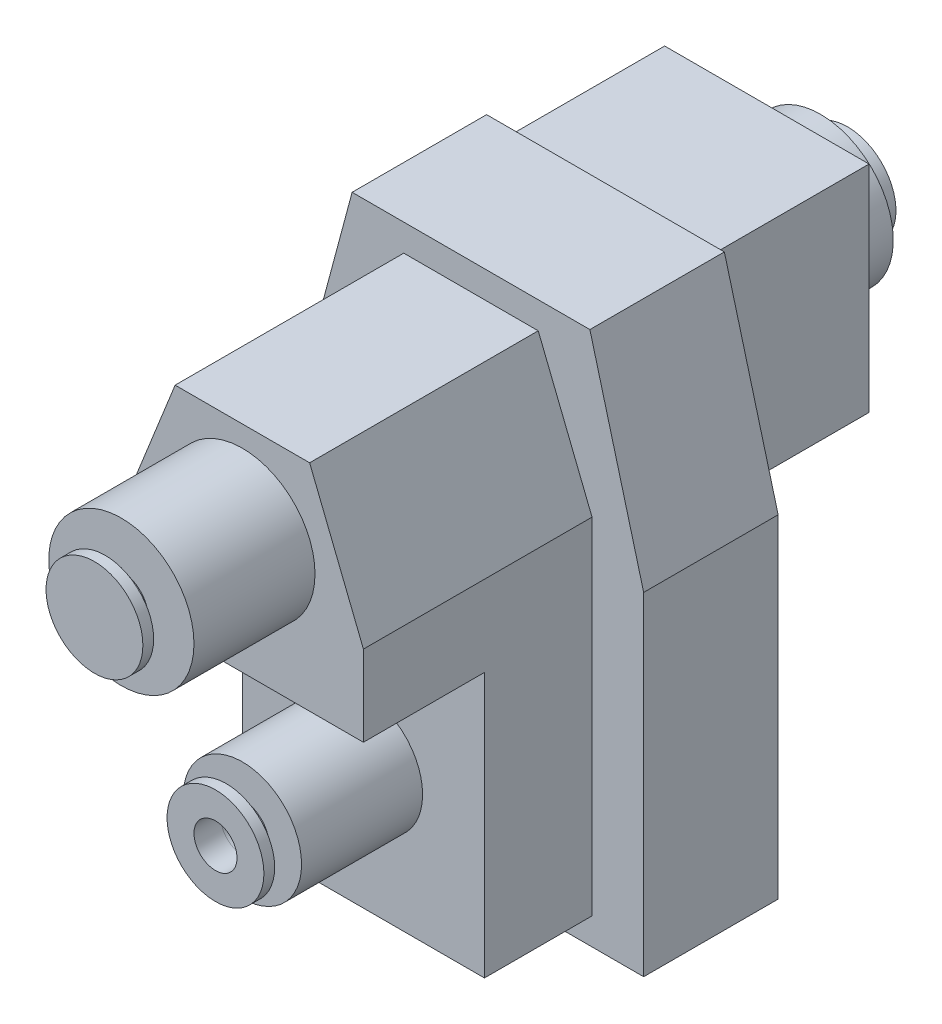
ISO-10303-21;
HEADER;
FILE_DESCRIPTION(('STEP AP214'),'2;1');
FILE_NAME('part.step','',(''),(''),'','','');
FILE_SCHEMA(('AUTOMOTIVE_DESIGN { 1 0 10303 214 1 1 1 1 }'));
ENDSEC;
DATA;
#1=APPLICATION_CONTEXT('core data for automotive mechanical design processes');
#2=APPLICATION_PROTOCOL_DEFINITION('international standard','automotive_design',2000,#1);
#3=PRODUCT_CONTEXT('',#1,'mechanical');
#4=PRODUCT('Part','Part','',(#3));
#5=PRODUCT_RELATED_PRODUCT_CATEGORY('part','',(#4));
#6=PRODUCT_DEFINITION_FORMATION('','',#4);
#7=PRODUCT_DEFINITION_CONTEXT('part definition',#1,'design');
#8=PRODUCT_DEFINITION('design','',#6,#7);
#9=PRODUCT_DEFINITION_SHAPE('','',#8);
#10=(LENGTH_UNIT() NAMED_UNIT(*) SI_UNIT(.MILLI.,.METRE.));
#11=(NAMED_UNIT(*) PLANE_ANGLE_UNIT() SI_UNIT($,.RADIAN.));
#12=(NAMED_UNIT(*) SI_UNIT($,.STERADIAN.) SOLID_ANGLE_UNIT());
#13=UNCERTAINTY_MEASURE_WITH_UNIT(LENGTH_MEASURE(1.E-05),#10,'distance_accuracy_value','');
#14=(GEOMETRIC_REPRESENTATION_CONTEXT(3) GLOBAL_UNCERTAINTY_ASSIGNED_CONTEXT((#13)) GLOBAL_UNIT_ASSIGNED_CONTEXT((#10,
#11,#12)) REPRESENTATION_CONTEXT('',''));
#15=CARTESIAN_POINT('',(0.,0.,0.));
#16=DIRECTION('',(0.,0.,1.));
#17=DIRECTION('',(1.,0.,0.));
#18=AXIS2_PLACEMENT_3D('',#15,#16,#17);
#19=CARTESIAN_POINT('',(0.,-208.,-140.));
#20=DIRECTION('',(0.,0.,1.));
#21=DIRECTION('',(1.,0.,0.));
#22=AXIS2_PLACEMENT_3D('',#19,#20,#21);
#23=CYLINDRICAL_SURFACE('',#22,50.);
#24=CARTESIAN_POINT('',(0.,-208.,-120.));
#25=DIRECTION('',(0.,0.,1.));
#26=DIRECTION('',(1.,0.,0.));
#27=AXIS2_PLACEMENT_3D('',#24,#25,#26);
#28=CIRCLE('',#27,50.);
#29=CARTESIAN_POINT('',(50.0000000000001,-208.,-120.));
#30=VERTEX_POINT('',#29);
#31=EDGE_CURVE('E11',#30,#30,#28,.F.);
#32=ORIENTED_EDGE('',*,*,#31,.F.);
#33=EDGE_LOOP('',(#32));
#34=FACE_BOUND('',#33,.T.);
#35=CARTESIAN_POINT('',(0.,-208.,-90.));
#36=DIRECTION('',(0.,0.,1.));
#37=DIRECTION('',(1.,0.,0.));
#38=AXIS2_PLACEMENT_3D('',#35,#36,#37);
#39=CIRCLE('',#38,50.);
#40=CARTESIAN_POINT('',(50.0000000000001,-208.,-90.));
#41=VERTEX_POINT('',#40);
#42=EDGE_CURVE('E59',#41,#41,#39,.T.);
#43=ORIENTED_EDGE('',*,*,#42,.F.);
#44=EDGE_LOOP('',(#43));
#45=FACE_BOUND('',#44,.T.);
#46=ADVANCED_FACE('F53',(#34,#45),#23,.T.);
#47=CARTESIAN_POINT('',(0.,-208.,-90.));
#48=DIRECTION('',(0.,0.,1.));
#49=DIRECTION('',(1.,0.,0.));
#50=AXIS2_PLACEMENT_3D('',#47,#48,#49);
#51=PLANE('',#50);
#52=CARTESIAN_POINT('',(0.,-208.,-90.));
#53=DIRECTION('',(0.,0.,1.));
#54=DIRECTION('',(1.,0.,0.));
#55=AXIS2_PLACEMENT_3D('',#52,#53,#54);
#56=CIRCLE('',#55,40.);
#57=CARTESIAN_POINT('',(40.0000000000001,-208.,-90.));
#58=VERTEX_POINT('',#57);
#59=EDGE_CURVE('E71',#58,#58,#56,.T.);
#60=ORIENTED_EDGE('',*,*,#59,.F.);
#61=EDGE_LOOP('',(#60));
#62=FACE_BOUND('',#61,.T.);
#63=ORIENTED_EDGE('',*,*,#42,.T.);
#64=EDGE_LOOP('',(#63));
#65=FACE_BOUND('',#64,.T.);
#66=ADVANCED_FACE('F96',(#62,#65),#51,.T.);
#67=CARTESIAN_POINT('',(0.,-208.,-120.));
#68=DIRECTION('',(0.,0.,1.));
#69=DIRECTION('',(1.,0.,0.));
#70=AXIS2_PLACEMENT_3D('',#67,#68,#69);
#71=PLANE('',#70);
#72=CARTESIAN_POINT('',(0.,-208.,-120.));
#73=DIRECTION('',(0.,0.,1.));
#74=DIRECTION('',(1.,0.,0.));
#75=AXIS2_PLACEMENT_3D('',#72,#73,#74);
#76=CIRCLE('',#75,90.);
#77=CARTESIAN_POINT('',(90.0000000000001,-208.,-120.));
#78=VERTEX_POINT('',#77);
#79=EDGE_CURVE('E63',#78,#78,#76,.T.);
#80=ORIENTED_EDGE('',*,*,#79,.T.);
#81=EDGE_LOOP('',(#80));
#82=FACE_BOUND('',#81,.T.);
#83=ORIENTED_EDGE('',*,*,#31,.T.);
#84=EDGE_LOOP('',(#83));
#85=FACE_BOUND('',#84,.T.);
#86=ADVANCED_FACE('F89',(#82,#85),#71,.T.);
#87=CARTESIAN_POINT('',(0.,-208.,-120.));
#88=DIRECTION('',(0.,0.,-1.));
#89=DIRECTION('',(-1.,0.,0.));
#90=AXIS2_PLACEMENT_3D('',#87,#88,#89);
#91=CYLINDRICAL_SURFACE('',#90,90.);
#92=ORIENTED_EDGE('',*,*,#79,.F.);
#93=EDGE_LOOP('',(#92));
#94=FACE_BOUND('',#93,.T.);
#95=CARTESIAN_POINT('',(0.,-208.,-140.));
#96=DIRECTION('',(0.,0.,1.));
#97=DIRECTION('',(1.,0.,0.));
#98=AXIS2_PLACEMENT_3D('',#95,#96,#97);
#99=CIRCLE('',#98,90.);
#100=CARTESIAN_POINT('',(90.0000000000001,-208.,-140.));
#101=VERTEX_POINT('',#100);
#102=EDGE_CURVE('E67',#101,#101,#99,.T.);
#103=ORIENTED_EDGE('',*,*,#102,.T.);
#104=EDGE_LOOP('',(#103));
#105=FACE_BOUND('',#104,.T.);
#106=ADVANCED_FACE('F84',(#94,#105),#91,.T.);
#107=CARTESIAN_POINT('',(0.,-208.,-140.));
#108=DIRECTION('',(0.,0.,1.));
#109=DIRECTION('',(1.,0.,0.));
#110=AXIS2_PLACEMENT_3D('',#107,#108,#109);
#111=PLANE('',#110);
#112=CARTESIAN_POINT('',(0.,-208.,-140.));
#113=DIRECTION('',(0.,0.,-1.));
#114=DIRECTION('',(-1.,0.,0.));
#115=AXIS2_PLACEMENT_3D('',#112,#113,#114);
#116=CIRCLE('',#115,40.);
#117=CARTESIAN_POINT('',(-39.9999999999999,-208.,-140.));
#118=VERTEX_POINT('',#117);
#119=EDGE_CURVE('E75',#118,#118,#116,.T.);
#120=ORIENTED_EDGE('',*,*,#119,.F.);
#121=EDGE_LOOP('',(#120));
#122=FACE_BOUND('',#121,.T.);
#123=ORIENTED_EDGE('',*,*,#102,.F.);
#124=EDGE_LOOP('',(#123));
#125=FACE_BOUND('',#124,.T.);
#126=ADVANCED_FACE('F81',(#122,#125),#111,.F.);
#127=CARTESIAN_POINT('',(0.,-208.,-15.));
#128=DIRECTION('',(0.,0.,-1.));
#129=DIRECTION('',(-1.,0.,0.));
#130=AXIS2_PLACEMENT_3D('',#127,#128,#129);
#131=CYLINDRICAL_SURFACE('',#130,40.);
#132=ORIENTED_EDGE('',*,*,#59,.T.);
#133=EDGE_LOOP('',(#132));
#134=FACE_BOUND('',#133,.T.);
#135=ORIENTED_EDGE('',*,*,#119,.T.);
#136=EDGE_LOOP('',(#135));
#137=FACE_BOUND('',#136,.T.);
#138=ADVANCED_FACE('F79',(#134,#137),#131,.F.);
#139=CLOSED_SHELL('',(#46,#66,#86,#106,#126,#138));
#140=MANIFOLD_SOLID_BREP('B2',#139);
#141=CARTESIAN_POINT('',(0.,-208.,725.));
#142=DIRECTION('',(0.,0.,-1.));
#143=DIRECTION('',(-1.,0.,0.));
#144=AXIS2_PLACEMENT_3D('',#141,#142,#143);
#145=CYLINDRICAL_SURFACE('',#144,50.);
#146=CARTESIAN_POINT('',(0.,-208.,675.));
#147=DIRECTION('',(0.,0.,1.));
#148=DIRECTION('',(1.,0.,0.));
#149=AXIS2_PLACEMENT_3D('',#146,#147,#148);
#150=CIRCLE('',#149,50.);
#151=CARTESIAN_POINT('',(50.0000000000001,-208.,675.));
#152=VERTEX_POINT('',#151);
#153=EDGE_CURVE('E174',#152,#152,#150,.T.);
#154=ORIENTED_EDGE('',*,*,#153,.T.);
#155=EDGE_LOOP('',(#154));
#156=FACE_BOUND('',#155,.T.);
#157=CARTESIAN_POINT('',(0.,-208.,705.));
#158=DIRECTION('',(0.,0.,1.));
#159=DIRECTION('',(1.,0.,0.));
#160=AXIS2_PLACEMENT_3D('',#157,#158,#159);
#161=CIRCLE('',#160,50.);
#162=CARTESIAN_POINT('',(50.0000000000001,-208.,705.));
#163=VERTEX_POINT('',#162);
#164=EDGE_CURVE('E52',#163,#163,#161,.T.);
#165=ORIENTED_EDGE('',*,*,#164,.F.);
#166=EDGE_LOOP('',(#165));
#167=FACE_BOUND('',#166,.T.);
#168=ADVANCED_FACE('F168',(#156,#167),#145,.T.);
#169=CARTESIAN_POINT('',(0.,0.,675.));
#170=DIRECTION('',(0.,0.,1.));
#171=DIRECTION('',(1.,0.,0.));
#172=AXIS2_PLACEMENT_3D('',#169,#170,#171);
#173=PLANE('',#172);
#174=CARTESIAN_POINT('',(0.,-208.,675.));
#175=DIRECTION('',(0.,0.,1.));
#176=DIRECTION('',(1.,0.,0.));
#177=AXIS2_PLACEMENT_3D('',#174,#175,#176);
#178=CIRCLE('',#177,40.);
#179=CARTESIAN_POINT('',(40.0000000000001,-208.,675.));
#180=VERTEX_POINT('',#179);
#181=EDGE_CURVE('E186',#180,#180,#178,.T.);
#182=ORIENTED_EDGE('',*,*,#181,.T.);
#183=EDGE_LOOP('',(#182));
#184=FACE_BOUND('',#183,.T.);
#185=ORIENTED_EDGE('',*,*,#153,.F.);
#186=EDGE_LOOP('',(#185));
#187=FACE_BOUND('',#186,.T.);
#188=ADVANCED_FACE('F206',(#184,#187),#173,.F.);
#189=CARTESIAN_POINT('',(0.,-208.,705.));
#190=DIRECTION('',(0.,0.,1.));
#191=DIRECTION('',(1.,0.,0.));
#192=AXIS2_PLACEMENT_3D('',#189,#190,#191);
#193=CYLINDRICAL_SURFACE('',#192,90.);
#194=CARTESIAN_POINT('',(0.,-208.,705.));
#195=DIRECTION('',(0.,0.,1.));
#196=DIRECTION('',(1.,0.,0.));
#197=AXIS2_PLACEMENT_3D('',#194,#195,#196);
#198=CIRCLE('',#197,90.);
#199=CARTESIAN_POINT('',(90.0000000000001,-208.,705.));
#200=VERTEX_POINT('',#199);
#201=EDGE_CURVE('E178',#200,#200,#198,.T.);
#202=ORIENTED_EDGE('',*,*,#201,.T.);
#203=EDGE_LOOP('',(#202));
#204=FACE_BOUND('',#203,.T.);
#205=CARTESIAN_POINT('',(0.,-208.,725.));
#206=DIRECTION('',(0.,0.,1.));
#207=DIRECTION('',(1.,0.,0.));
#208=AXIS2_PLACEMENT_3D('',#205,#206,#207);
#209=CIRCLE('',#208,90.);
#210=CARTESIAN_POINT('',(90.0000000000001,-208.,725.));
#211=VERTEX_POINT('',#210);
#212=EDGE_CURVE('E182',#211,#211,#209,.T.);
#213=ORIENTED_EDGE('',*,*,#212,.F.);
#214=EDGE_LOOP('',(#213));
#215=FACE_BOUND('',#214,.T.);
#216=ADVANCED_FACE('F204',(#204,#215),#193,.T.);
#217=CARTESIAN_POINT('',(0.,-208.,705.));
#218=DIRECTION('',(0.,0.,1.));
#219=DIRECTION('',(1.,0.,0.));
#220=AXIS2_PLACEMENT_3D('',#217,#218,#219);
#221=PLANE('',#220);
#222=ORIENTED_EDGE('',*,*,#164,.T.);
#223=EDGE_LOOP('',(#222));
#224=FACE_BOUND('',#223,.T.);
#225=ORIENTED_EDGE('',*,*,#201,.F.);
#226=EDGE_LOOP('',(#225));
#227=FACE_BOUND('',#226,.T.);
#228=ADVANCED_FACE('F200',(#224,#227),#221,.F.);
#229=CARTESIAN_POINT('',(0.,0.,725.));
#230=DIRECTION('',(0.,0.,1.));
#231=DIRECTION('',(1.,0.,0.));
#232=AXIS2_PLACEMENT_3D('',#229,#230,#231);
#233=PLANE('',#232);
#234=CARTESIAN_POINT('',(0.,-208.,725.));
#235=DIRECTION('',(0.,0.,1.));
#236=DIRECTION('',(1.,0.,0.));
#237=AXIS2_PLACEMENT_3D('',#234,#235,#236);
#238=CIRCLE('',#237,40.);
#239=CARTESIAN_POINT('',(40.0000000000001,-208.,725.));
#240=VERTEX_POINT('',#239);
#241=EDGE_CURVE('E190',#240,#240,#238,.T.);
#242=ORIENTED_EDGE('',*,*,#241,.F.);
#243=EDGE_LOOP('',(#242));
#244=FACE_BOUND('',#243,.T.);
#245=ORIENTED_EDGE('',*,*,#212,.T.);
#246=EDGE_LOOP('',(#245));
#247=FACE_BOUND('',#246,.T.);
#248=ADVANCED_FACE('F197',(#244,#247),#233,.T.);
#249=CARTESIAN_POINT('',(0.,-208.,600.));
#250=DIRECTION('',(0.,0.,1.));
#251=DIRECTION('',(1.,0.,0.));
#252=AXIS2_PLACEMENT_3D('',#249,#250,#251);
#253=CYLINDRICAL_SURFACE('',#252,40.);
#254=ORIENTED_EDGE('',*,*,#241,.T.);
#255=EDGE_LOOP('',(#254));
#256=FACE_BOUND('',#255,.T.);
#257=ORIENTED_EDGE('',*,*,#181,.F.);
#258=EDGE_LOOP('',(#257));
#259=FACE_BOUND('',#258,.T.);
#260=ADVANCED_FACE('F194',(#256,#259),#253,.F.);
#261=CLOSED_SHELL('',(#168,#188,#216,#228,#248,#260));
#262=MANIFOLD_SOLID_BREP('B6',#261);
#263=CARTESIAN_POINT('',(0.,272.,-450.));
#264=DIRECTION('',(0.,0.,1.));
#265=DIRECTION('',(1.,0.,0.));
#266=AXIS2_PLACEMENT_3D('',#263,#264,#265);
#267=CYLINDRICAL_SURFACE('',#266,50.);
#268=CARTESIAN_POINT('',(0.,272.,-400.));
#269=DIRECTION('',(0.,0.,-1.));
#270=DIRECTION('',(-1.,0.,0.));
#271=AXIS2_PLACEMENT_3D('',#268,#269,#270);
#272=CIRCLE('',#271,50.);
#273=CARTESIAN_POINT('',(-50.,272.,-400.));
#274=VERTEX_POINT('',#273);
#275=EDGE_CURVE('E288',#274,#274,#272,.T.);
#276=ORIENTED_EDGE('',*,*,#275,.T.);
#277=EDGE_LOOP('',(#276));
#278=FACE_BOUND('',#277,.T.);
#279=CARTESIAN_POINT('',(0.,272.,-430.));
#280=DIRECTION('',(0.,0.,-1.));
#281=DIRECTION('',(-1.,0.,0.));
#282=AXIS2_PLACEMENT_3D('',#279,#280,#281);
#283=CIRCLE('',#282,50.);
#284=CARTESIAN_POINT('',(-50.,272.,-430.));
#285=VERTEX_POINT('',#284);
#286=EDGE_CURVE('E167',#285,#285,#283,.T.);
#287=ORIENTED_EDGE('',*,*,#286,.F.);
#288=EDGE_LOOP('',(#287));
#289=FACE_BOUND('',#288,.T.);
#290=ADVANCED_FACE('F282',(#278,#289),#267,.T.);
#291=CARTESIAN_POINT('',(0.,272.,-400.));
#292=DIRECTION('',(0.,0.,-1.));
#293=DIRECTION('',(-1.,0.,0.));
#294=AXIS2_PLACEMENT_3D('',#291,#292,#293);
#295=PLANE('',#294);
#296=ORIENTED_EDGE('',*,*,#275,.F.);
#297=EDGE_LOOP('',(#296));
#298=FACE_BOUND('',#297,.T.);
#299=ADVANCED_FACE('F307',(#298),#295,.F.);
#300=CARTESIAN_POINT('',(0.,272.,-430.));
#301=DIRECTION('',(0.,0.,-1.));
#302=DIRECTION('',(-1.,0.,0.));
#303=AXIS2_PLACEMENT_3D('',#300,#301,#302);
#304=CYLINDRICAL_SURFACE('',#303,90.);
#305=CARTESIAN_POINT('',(0.,272.,-430.));
#306=DIRECTION('',(0.,0.,-1.));
#307=DIRECTION('',(-1.,0.,0.));
#308=AXIS2_PLACEMENT_3D('',#305,#306,#307);
#309=CIRCLE('',#308,90.);
#310=CARTESIAN_POINT('',(-90.,272.,-430.));
#311=VERTEX_POINT('',#310);
#312=EDGE_CURVE('E292',#311,#311,#309,.T.);
#313=ORIENTED_EDGE('',*,*,#312,.T.);
#314=EDGE_LOOP('',(#313));
#315=FACE_BOUND('',#314,.T.);
#316=CARTESIAN_POINT('',(0.,272.,-450.));
#317=DIRECTION('',(0.,0.,-1.));
#318=DIRECTION('',(-1.,0.,0.));
#319=AXIS2_PLACEMENT_3D('',#316,#317,#318);
#320=CIRCLE('',#319,90.);
#321=CARTESIAN_POINT('',(-90.,272.,-450.));
#322=VERTEX_POINT('',#321);
#323=EDGE_CURVE('E296',#322,#322,#320,.T.);
#324=ORIENTED_EDGE('',*,*,#323,.F.);
#325=EDGE_LOOP('',(#324));
#326=FACE_BOUND('',#325,.T.);
#327=ADVANCED_FACE('F304',(#315,#326),#304,.T.);
#328=CARTESIAN_POINT('',(0.,272.,-430.));
#329=DIRECTION('',(0.,0.,-1.));
#330=DIRECTION('',(-1.,0.,0.));
#331=AXIS2_PLACEMENT_3D('',#328,#329,#330);
#332=PLANE('',#331);
#333=ORIENTED_EDGE('',*,*,#286,.T.);
#334=EDGE_LOOP('',(#333));
#335=FACE_BOUND('',#334,.T.);
#336=ORIENTED_EDGE('',*,*,#312,.F.);
#337=EDGE_LOOP('',(#336));
#338=FACE_BOUND('',#337,.T.);
#339=ADVANCED_FACE('F306',(#335,#338),#332,.F.);
#340=CARTESIAN_POINT('',(0.,272.,-450.));
#341=DIRECTION('',(0.,0.,-1.));
#342=DIRECTION('',(-1.,0.,0.));
#343=AXIS2_PLACEMENT_3D('',#340,#341,#342);
#344=PLANE('',#343);
#345=ORIENTED_EDGE('',*,*,#323,.T.);
#346=EDGE_LOOP('',(#345));
#347=FACE_BOUND('',#346,.T.);
#348=ADVANCED_FACE('F302',(#347),#344,.T.);
#349=CLOSED_SHELL('',(#290,#299,#327,#339,#348));
#350=MANIFOLD_SOLID_BREP('B47',#349);
#351=CARTESIAN_POINT('',(0.,272.,950.));
#352=DIRECTION('',(0.,0.,-1.));
#353=DIRECTION('',(-1.,0.,0.));
#354=AXIS2_PLACEMENT_3D('',#351,#352,#353);
#355=CYLINDRICAL_SURFACE('',#354,50.);
#356=CARTESIAN_POINT('',(0.,272.,900.));
#357=DIRECTION('',(0.,0.,1.));
#358=DIRECTION('',(1.,0.,0.));
#359=AXIS2_PLACEMENT_3D('',#356,#357,#358);
#360=CIRCLE('',#359,50.);
#361=CARTESIAN_POINT('',(50.,272.,900.));
#362=VERTEX_POINT('',#361);
#363=EDGE_CURVE('E380',#362,#362,#360,.T.);
#364=ORIENTED_EDGE('',*,*,#363,.T.);
#365=EDGE_LOOP('',(#364));
#366=FACE_BOUND('',#365,.T.);
#367=CARTESIAN_POINT('',(0.,272.,930.));
#368=DIRECTION('',(0.,0.,1.));
#369=DIRECTION('',(1.,0.,0.));
#370=AXIS2_PLACEMENT_3D('',#367,#368,#369);
#371=CIRCLE('',#370,50.);
#372=CARTESIAN_POINT('',(50.,272.,930.));
#373=VERTEX_POINT('',#372);
#374=EDGE_CURVE('E281',#373,#373,#371,.T.);
#375=ORIENTED_EDGE('',*,*,#374,.F.);
#376=EDGE_LOOP('',(#375));
#377=FACE_BOUND('',#376,.T.);
#378=ADVANCED_FACE('F374',(#366,#377),#355,.T.);
#379=CARTESIAN_POINT('',(0.,0.,900.));
#380=DIRECTION('',(0.,0.,1.));
#381=DIRECTION('',(1.,0.,0.));
#382=AXIS2_PLACEMENT_3D('',#379,#380,#381);
#383=PLANE('',#382);
#384=ORIENTED_EDGE('',*,*,#363,.F.);
#385=EDGE_LOOP('',(#384));
#386=FACE_BOUND('',#385,.T.);
#387=ADVANCED_FACE('F399',(#386),#383,.F.);
#388=CARTESIAN_POINT('',(0.,272.,930.));
#389=DIRECTION('',(0.,0.,1.));
#390=DIRECTION('',(1.,0.,0.));
#391=AXIS2_PLACEMENT_3D('',#388,#389,#390);
#392=CYLINDRICAL_SURFACE('',#391,90.);
#393=CARTESIAN_POINT('',(0.,272.,930.));
#394=DIRECTION('',(0.,0.,1.));
#395=DIRECTION('',(1.,0.,0.));
#396=AXIS2_PLACEMENT_3D('',#393,#394,#395);
#397=CIRCLE('',#396,90.);
#398=CARTESIAN_POINT('',(90.,272.,930.));
#399=VERTEX_POINT('',#398);
#400=EDGE_CURVE('E384',#399,#399,#397,.T.);
#401=ORIENTED_EDGE('',*,*,#400,.T.);
#402=EDGE_LOOP('',(#401));
#403=FACE_BOUND('',#402,.T.);
#404=CARTESIAN_POINT('',(0.,272.,950.));
#405=DIRECTION('',(0.,0.,1.));
#406=DIRECTION('',(1.,0.,0.));
#407=AXIS2_PLACEMENT_3D('',#404,#405,#406);
#408=CIRCLE('',#407,90.);
#409=CARTESIAN_POINT('',(90.,272.,950.));
#410=VERTEX_POINT('',#409);
#411=EDGE_CURVE('E388',#410,#410,#408,.T.);
#412=ORIENTED_EDGE('',*,*,#411,.F.);
#413=EDGE_LOOP('',(#412));
#414=FACE_BOUND('',#413,.T.);
#415=ADVANCED_FACE('F396',(#403,#414),#392,.T.);
#416=CARTESIAN_POINT('',(0.,272.,930.));
#417=DIRECTION('',(0.,0.,1.));
#418=DIRECTION('',(1.,0.,0.));
#419=AXIS2_PLACEMENT_3D('',#416,#417,#418);
#420=PLANE('',#419);
#421=ORIENTED_EDGE('',*,*,#374,.T.);
#422=EDGE_LOOP('',(#421));
#423=FACE_BOUND('',#422,.T.);
#424=ORIENTED_EDGE('',*,*,#400,.F.);
#425=EDGE_LOOP('',(#424));
#426=FACE_BOUND('',#425,.T.);
#427=ADVANCED_FACE('F398',(#423,#426),#420,.F.);
#428=CARTESIAN_POINT('',(0.,0.,950.));
#429=DIRECTION('',(0.,0.,1.));
#430=DIRECTION('',(1.,0.,0.));
#431=AXIS2_PLACEMENT_3D('',#428,#429,#430);
#432=PLANE('',#431);
#433=ORIENTED_EDGE('',*,*,#411,.T.);
#434=EDGE_LOOP('',(#433));
#435=FACE_BOUND('',#434,.T.);
#436=ADVANCED_FACE('F394',(#435),#432,.T.);
#437=CLOSED_SHELL('',(#378,#387,#415,#427,#436));
#438=MANIFOLD_SOLID_BREP('B162',#437);
#439=CARTESIAN_POINT('',(-321.,-496.,250.));
#440=DIRECTION('',(0.,1.,0.));
#441=DIRECTION('',(0.,0.,1.));
#442=AXIS2_PLACEMENT_3D('',#439,#440,#441);
#443=PLANE('',#442);
#444=DIRECTION('',(1.,0.,0.));
#445=VECTOR('',#444,1.);
#446=CARTESIAN_POINT('',(-321.,-496.,0.));
#447=LINE('',#446,#445);
#448=CARTESIAN_POINT('',(-321.,-496.,0.));
#449=VERTEX_POINT('',#448);
#450=CARTESIAN_POINT('',(321.,-496.,0.));
#451=VERTEX_POINT('',#450);
#452=EDGE_CURVE('E952',#449,#451,#447,.T.);
#453=ORIENTED_EDGE('',*,*,#452,.T.);
#454=DIRECTION('',(0.,0.,-1.));
#455=VECTOR('',#454,1.);
#456=CARTESIAN_POINT('',(321.,-496.,250.));
#457=LINE('',#456,#455);
#458=CARTESIAN_POINT('',(321.,-496.,250.));
#459=VERTEX_POINT('',#458);
#460=EDGE_CURVE('E959',#459,#451,#457,.T.);
#461=ORIENTED_EDGE('',*,*,#460,.F.);
#462=DIRECTION('',(1.,0.,0.));
#463=VECTOR('',#462,1.);
#464=CARTESIAN_POINT('',(-321.,-496.,250.));
#465=LINE('',#464,#463);
#466=CARTESIAN_POINT('',(-321.,-496.,250.));
#467=VERTEX_POINT('',#466);
#468=EDGE_CURVE('E957',#467,#459,#465,.T.);
#469=ORIENTED_EDGE('',*,*,#468,.F.);
#470=DIRECTION('',(0.,0.,-1.));
#471=VECTOR('',#470,1.);
#472=CARTESIAN_POINT('',(-321.,-496.,250.));
#473=LINE('',#472,#471);
#474=EDGE_CURVE('E969',#467,#449,#473,.T.);
#475=ORIENTED_EDGE('',*,*,#474,.T.);
#476=EDGE_LOOP('',(#453,#461,#469,#475));
#477=FACE_BOUND('',#476,.T.);
#478=ADVANCED_FACE('F459',(#477),#443,.F.);
#479=CARTESIAN_POINT('',(0.,0.,0.));
#480=DIRECTION('',(0.,0.,-1.));
#481=DIRECTION('',(-1.,0.,0.));
#482=AXIS2_PLACEMENT_3D('',#479,#480,#481);
#483=PLANE('',#482);
#484=ORIENTED_EDGE('',*,*,#452,.F.);
#485=DIRECTION('',(0.,-1.,0.));
#486=VECTOR('',#485,1.);
#487=CARTESIAN_POINT('',(-321.,-496.,0.));
#488=LINE('',#487,#486);
#489=CARTESIAN_POINT('',(-321.,122.794919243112,0.));
#490=VERTEX_POINT('',#489);
#491=EDGE_CURVE('E964',#490,#449,#488,.T.);
#492=ORIENTED_EDGE('',*,*,#491,.F.);
#493=DIRECTION('',(-0.258819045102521,-0.965925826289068,0.));
#494=VECTOR('',#493,1.);
#495=CARTESIAN_POINT('',(-330.19580711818,88.4756998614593,0.));
#496=LINE('',#495,#494);
#497=CARTESIAN_POINT('',(-221.,496.,0.));
#498=VERTEX_POINT('',#497);
#499=EDGE_CURVE('E977',#490,#498,#496,.F.);
#500=ORIENTED_EDGE('',*,*,#499,.T.);
#501=DIRECTION('',(-1.,0.,0.));
#502=VECTOR('',#501,1.);
#503=CARTESIAN_POINT('',(-321.,496.,0.));
#504=LINE('',#503,#502);
#505=CARTESIAN_POINT('',(221.,496.,0.));
#506=VERTEX_POINT('',#505);
#507=EDGE_CURVE('E961',#506,#498,#504,.T.);
#508=ORIENTED_EDGE('',*,*,#507,.F.);
#509=DIRECTION('',(-0.258819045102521,0.965925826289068,0.));
#510=VECTOR('',#509,1.);
#511=CARTESIAN_POINT('',(330.195807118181,88.4756998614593,0.));
#512=LINE('',#511,#510);
#513=CARTESIAN_POINT('',(321.,122.794919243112,0.));
#514=VERTEX_POINT('',#513);
#515=EDGE_CURVE('E979',#506,#514,#512,.F.);
#516=ORIENTED_EDGE('',*,*,#515,.T.);
#517=DIRECTION('',(0.,1.,0.));
#518=VECTOR('',#517,1.);
#519=CARTESIAN_POINT('',(321.,-496.,0.));
#520=LINE('',#519,#518);
#521=EDGE_CURVE('E948',#451,#514,#520,.T.);
#522=ORIENTED_EDGE('',*,*,#521,.F.);
#523=EDGE_LOOP('',(#484,#492,#500,#508,#516,#522));
#524=FACE_BOUND('',#523,.T.);
#525=CARTESIAN_POINT('',(0.,-208.,0.));
#526=DIRECTION('',(0.,0.,-1.));
#527=DIRECTION('',(-1.,0.,0.));
#528=AXIS2_PLACEMENT_3D('',#525,#526,#527);
#529=CIRCLE('',#528,110.);
#530=CARTESIAN_POINT('',(-110.,-208.,0.));
#531=VERTEX_POINT('',#530);
#532=EDGE_CURVE('E470',#531,#531,#529,.T.);
#533=ORIENTED_EDGE('',*,*,#532,.F.);
#534=EDGE_LOOP('',(#533));
#535=FACE_BOUND('',#534,.T.);
#536=DIRECTION('',(1.,0.,0.));
#537=VECTOR('',#536,1.);
#538=CARTESIAN_POINT('',(190.,472.,0.));
#539=LINE('',#538,#537);
#540=CARTESIAN_POINT('',(-190.,472.,0.));
#541=VERTEX_POINT('',#540);
#542=CARTESIAN_POINT('',(190.,472.,0.));
#543=VERTEX_POINT('',#542);
#544=EDGE_CURVE('E864',#541,#543,#539,.T.);
#545=ORIENTED_EDGE('',*,*,#544,.F.);
#546=DIRECTION('',(0.,1.,0.));
#547=VECTOR('',#546,1.);
#548=CARTESIAN_POINT('',(-190.,72.0000000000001,0.));
#549=LINE('',#548,#547);
#550=CARTESIAN_POINT('',(-190.,72.0000000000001,0.));
#551=VERTEX_POINT('',#550);
#552=EDGE_CURVE('E846',#551,#541,#549,.T.);
#553=ORIENTED_EDGE('',*,*,#552,.F.);
#554=DIRECTION('',(-1.,0.,0.));
#555=VECTOR('',#554,1.);
#556=CARTESIAN_POINT('',(190.,72.0000000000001,0.));
#557=LINE('',#556,#555);
#558=CARTESIAN_POINT('',(190.,72.0000000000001,0.));
#559=VERTEX_POINT('',#558);
#560=EDGE_CURVE('E855',#559,#551,#557,.T.);
#561=ORIENTED_EDGE('',*,*,#560,.F.);
#562=DIRECTION('',(0.,-1.,0.));
#563=VECTOR('',#562,1.);
#564=CARTESIAN_POINT('',(190.,72.0000000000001,0.));
#565=LINE('',#564,#563);
#566=EDGE_CURVE('E866',#543,#559,#565,.T.);
#567=ORIENTED_EDGE('',*,*,#566,.F.);
#568=EDGE_LOOP('',(#545,#553,#561,#567));
#569=FACE_BOUND('',#568,.T.);
#570=ADVANCED_FACE('F1158',(#524,#535,#569),#483,.T.);
#571=CARTESIAN_POINT('',(0.,0.,450.));
#572=DIRECTION('',(0.,0.,1.));
#573=DIRECTION('',(1.,0.,0.));
#574=AXIS2_PLACEMENT_3D('',#571,#572,#573);
#575=PLANE('',#574);
#576=CARTESIAN_POINT('',(0.,-208.,450.));
#577=DIRECTION('',(0.,0.,1.));
#578=DIRECTION('',(1.,0.,0.));
#579=AXIS2_PLACEMENT_3D('',#576,#577,#578);
#580=CIRCLE('',#579,110.);
#581=CARTESIAN_POINT('',(110.,-208.,450.));
#582=VERTEX_POINT('',#581);
#583=EDGE_CURVE('E884',#582,#582,#580,.F.);
#584=ORIENTED_EDGE('',*,*,#583,.T.);
#585=EDGE_LOOP('',(#584));
#586=FACE_BOUND('',#585,.T.);
#587=DIRECTION('',(0.,1.,0.));
#588=VECTOR('',#587,1.);
#589=CARTESIAN_POINT('',(225.,0.,450.));
#590=LINE('',#589,#588);
#591=CARTESIAN_POINT('',(225.,-446.,450.));
#592=VERTEX_POINT('',#591);
#593=CARTESIAN_POINT('',(225.,46.0000000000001,450.));
#594=VERTEX_POINT('',#593);
#595=EDGE_CURVE('E912',#592,#594,#590,.T.);
#596=ORIENTED_EDGE('',*,*,#595,.T.);
#597=DIRECTION('',(-1.,0.,0.));
#598=VECTOR('',#597,1.);
#599=CARTESIAN_POINT('',(0.,46.0000000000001,450.));
#600=LINE('',#599,#598);
#601=CARTESIAN_POINT('',(-225.,46.0000000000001,450.));
#602=VERTEX_POINT('',#601);
#603=EDGE_CURVE('E850',#594,#602,#600,.T.);
#604=ORIENTED_EDGE('',*,*,#603,.T.);
#605=DIRECTION('',(0.,1.,0.));
#606=VECTOR('',#605,1.);
#607=CARTESIAN_POINT('',(-225.,0.,450.));
#608=LINE('',#607,#606);
#609=CARTESIAN_POINT('',(-225.,-446.,450.));
#610=VERTEX_POINT('',#609);
#611=EDGE_CURVE('E915',#610,#602,#608,.T.);
#612=ORIENTED_EDGE('',*,*,#611,.F.);
#613=DIRECTION('',(1.,0.,0.));
#614=VECTOR('',#613,1.);
#615=CARTESIAN_POINT('',(0.,-446.,450.));
#616=LINE('',#615,#614);
#617=EDGE_CURVE('E909',#610,#592,#616,.T.);
#618=ORIENTED_EDGE('',*,*,#617,.T.);
#619=EDGE_LOOP('',(#596,#604,#612,#618));
#620=FACE_BOUND('',#619,.T.);
#621=ADVANCED_FACE('F1154',(#586,#620),#575,.T.);
#622=CARTESIAN_POINT('',(0.,0.,250.));
#623=DIRECTION('',(0.,0.,-1.));
#624=DIRECTION('',(-1.,0.,0.));
#625=AXIS2_PLACEMENT_3D('',#622,#623,#624);
#626=PLANE('',#625);
#627=DIRECTION('',(0.371390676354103,-0.928476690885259,0.));
#628=VECTOR('',#627,1.);
#629=CARTESIAN_POINT('',(261.551724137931,104.620689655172,250.));
#630=LINE('',#629,#628);
#631=CARTESIAN_POINT('',(125.,446.,250.));
#632=VERTEX_POINT('',#631);
#633=CARTESIAN_POINT('',(225.,196.,250.));
#634=VERTEX_POINT('',#633);
#635=EDGE_CURVE('E923',#632,#634,#630,.T.);
#636=ORIENTED_EDGE('',*,*,#635,.T.);
#637=DIRECTION('',(0.,1.,0.));
#638=VECTOR('',#637,1.);
#639=CARTESIAN_POINT('',(225.,0.,250.));
#640=LINE('',#639,#638);
#641=CARTESIAN_POINT('',(225.,-446.,250.));
#642=VERTEX_POINT('',#641);
#643=EDGE_CURVE('E921',#642,#634,#640,.T.);
#644=ORIENTED_EDGE('',*,*,#643,.F.);
#645=DIRECTION('',(1.,0.,0.));
#646=VECTOR('',#645,1.);
#647=CARTESIAN_POINT('',(0.,-446.,250.));
#648=LINE('',#647,#646);
#649=CARTESIAN_POINT('',(-225.,-446.,250.));
#650=VERTEX_POINT('',#649);
#651=EDGE_CURVE('E908',#650,#642,#648,.T.);
#652=ORIENTED_EDGE('',*,*,#651,.F.);
#653=DIRECTION('',(0.,1.,0.));
#654=VECTOR('',#653,1.);
#655=CARTESIAN_POINT('',(-225.,0.,250.));
#656=LINE('',#655,#654);
#657=CARTESIAN_POINT('',(-225.,196.,250.));
#658=VERTEX_POINT('',#657);
#659=EDGE_CURVE('E913',#650,#658,#656,.T.);
#660=ORIENTED_EDGE('',*,*,#659,.T.);
#661=DIRECTION('',(0.371390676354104,0.928476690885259,0.));
#662=VECTOR('',#661,1.);
#663=CARTESIAN_POINT('',(-261.551724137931,104.620689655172,250.));
#664=LINE('',#663,#662);
#665=CARTESIAN_POINT('',(-125.,446.,250.));
#666=VERTEX_POINT('',#665);
#667=EDGE_CURVE('E928',#658,#666,#664,.T.);
#668=ORIENTED_EDGE('',*,*,#667,.T.);
#669=DIRECTION('',(1.,0.,0.));
#670=VECTOR('',#669,1.);
#671=CARTESIAN_POINT('',(-1.98063787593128E-13,446.,250.));
#672=LINE('',#671,#670);
#673=EDGE_CURVE('E926',#666,#632,#672,.T.);
#674=ORIENTED_EDGE('',*,*,#673,.T.);
#675=EDGE_LOOP('',(#636,#644,#652,#660,#668,#674));
#676=FACE_BOUND('',#675,.T.);
#677=DIRECTION('',(0.,1.,0.));
#678=VECTOR('',#677,1.);
#679=CARTESIAN_POINT('',(321.,-496.,250.));
#680=LINE('',#679,#678);
#681=CARTESIAN_POINT('',(321.,122.794919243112,250.));
#682=VERTEX_POINT('',#681);
#683=EDGE_CURVE('E949',#459,#682,#680,.T.);
#684=ORIENTED_EDGE('',*,*,#683,.T.);
#685=DIRECTION('',(0.258819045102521,-0.965925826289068,0.));
#686=VECTOR('',#685,1.);
#687=CARTESIAN_POINT('',(221.,496.,250.));
#688=LINE('',#687,#686);
#689=CARTESIAN_POINT('',(221.,496.,250.));
#690=VERTEX_POINT('',#689);
#691=EDGE_CURVE('E987',#682,#690,#688,.F.);
#692=ORIENTED_EDGE('',*,*,#691,.T.);
#693=DIRECTION('',(-1.,0.,0.));
#694=VECTOR('',#693,1.);
#695=CARTESIAN_POINT('',(-321.,496.,250.));
#696=LINE('',#695,#694);
#697=CARTESIAN_POINT('',(-221.,496.,250.));
#698=VERTEX_POINT('',#697);
#699=EDGE_CURVE('E951',#690,#698,#696,.T.);
#700=ORIENTED_EDGE('',*,*,#699,.T.);
#701=DIRECTION('',(0.258819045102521,0.965925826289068,0.));
#702=VECTOR('',#701,1.);
#703=CARTESIAN_POINT('',(-321.,122.794919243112,250.));
#704=LINE('',#703,#702);
#705=CARTESIAN_POINT('',(-321.,122.794919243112,250.));
#706=VERTEX_POINT('',#705);
#707=EDGE_CURVE('E985',#698,#706,#704,.F.);
#708=ORIENTED_EDGE('',*,*,#707,.T.);
#709=DIRECTION('',(0.,-1.,0.));
#710=VECTOR('',#709,1.);
#711=CARTESIAN_POINT('',(-321.,-496.,250.));
#712=LINE('',#711,#710);
#713=EDGE_CURVE('E955',#706,#467,#712,.T.);
#714=ORIENTED_EDGE('',*,*,#713,.T.);
#715=ORIENTED_EDGE('',*,*,#468,.T.);
#716=EDGE_LOOP('',(#684,#692,#700,#708,#714,#715));
#717=FACE_BOUND('',#716,.T.);
#718=ADVANCED_FACE('F1157',(#676,#717),#626,.F.);
#719=CARTESIAN_POINT('',(321.,-496.,250.));
#720=DIRECTION('',(-1.,0.,0.));
#721=DIRECTION('',(0.,0.,1.));
#722=AXIS2_PLACEMENT_3D('',#719,#720,#721);
#723=PLANE('',#722);
#724=ORIENTED_EDGE('',*,*,#521,.T.);
#725=DIRECTION('',(0.,0.,1.));
#726=VECTOR('',#725,1.);
#727=CARTESIAN_POINT('',(321.,122.794919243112,250.));
#728=LINE('',#727,#726);
#729=EDGE_CURVE('E982',#514,#682,#728,.T.);
#730=ORIENTED_EDGE('',*,*,#729,.T.);
#731=ORIENTED_EDGE('',*,*,#683,.F.);
#732=ORIENTED_EDGE('',*,*,#460,.T.);
#733=EDGE_LOOP('',(#724,#730,#731,#732));
#734=FACE_BOUND('',#733,.T.);
#735=ADVANCED_FACE('F1185',(#734),#723,.F.);
#736=CARTESIAN_POINT('',(-321.,496.,250.));
#737=DIRECTION('',(0.,-1.,0.));
#738=DIRECTION('',(0.,0.,-1.));
#739=AXIS2_PLACEMENT_3D('',#736,#737,#738);
#740=PLANE('',#739);
#741=ORIENTED_EDGE('',*,*,#699,.F.);
#742=DIRECTION('',(0.,0.,-1.));
#743=VECTOR('',#742,1.);
#744=CARTESIAN_POINT('',(221.,496.,250.));
#745=LINE('',#744,#743);
#746=EDGE_CURVE('E974',#690,#506,#745,.T.);
#747=ORIENTED_EDGE('',*,*,#746,.T.);
#748=ORIENTED_EDGE('',*,*,#507,.T.);
#749=DIRECTION('',(0.,0.,1.));
#750=VECTOR('',#749,1.);
#751=CARTESIAN_POINT('',(-221.,496.,250.));
#752=LINE('',#751,#750);
#753=EDGE_CURVE('E972',#498,#698,#752,.T.);
#754=ORIENTED_EDGE('',*,*,#753,.T.);
#755=EDGE_LOOP('',(#741,#747,#748,#754));
#756=FACE_BOUND('',#755,.T.);
#757=ADVANCED_FACE('F1197',(#756),#740,.F.);
#758=CARTESIAN_POINT('',(-321.,-496.,250.));
#759=DIRECTION('',(1.,0.,0.));
#760=DIRECTION('',(0.,0.,-1.));
#761=AXIS2_PLACEMENT_3D('',#758,#759,#760);
#762=PLANE('',#761);
#763=ORIENTED_EDGE('',*,*,#474,.F.);
#764=ORIENTED_EDGE('',*,*,#713,.F.);
#765=DIRECTION('',(0.,0.,-1.));
#766=VECTOR('',#765,1.);
#767=CARTESIAN_POINT('',(-321.,122.794919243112,250.));
#768=LINE('',#767,#766);
#769=EDGE_CURVE('E989',#706,#490,#768,.T.);
#770=ORIENTED_EDGE('',*,*,#769,.T.);
#771=ORIENTED_EDGE('',*,*,#491,.T.);
#772=EDGE_LOOP('',(#763,#764,#770,#771));
#773=FACE_BOUND('',#772,.T.);
#774=ADVANCED_FACE('F1193',(#773),#762,.F.);
#775=CARTESIAN_POINT('',(221.,496.,250.));
#776=DIRECTION('',(-0.965925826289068,-0.258819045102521,0.));
#777=DIRECTION('',(0.,0.,-1.));
#778=AXIS2_PLACEMENT_3D('',#775,#776,#777);
#779=PLANE('',#778);
#780=ORIENTED_EDGE('',*,*,#691,.F.);
#781=ORIENTED_EDGE('',*,*,#729,.F.);
#782=ORIENTED_EDGE('',*,*,#515,.F.);
#783=ORIENTED_EDGE('',*,*,#746,.F.);
#784=EDGE_LOOP('',(#780,#781,#782,#783));
#785=FACE_BOUND('',#784,.T.);
#786=ADVANCED_FACE('F1196',(#785),#779,.F.);
#787=CARTESIAN_POINT('',(-321.,122.794919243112,250.));
#788=DIRECTION('',(0.965925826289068,-0.258819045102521,0.));
#789=DIRECTION('',(0.,0.,-1.));
#790=AXIS2_PLACEMENT_3D('',#787,#788,#789);
#791=PLANE('',#790);
#792=ORIENTED_EDGE('',*,*,#707,.F.);
#793=ORIENTED_EDGE('',*,*,#753,.F.);
#794=ORIENTED_EDGE('',*,*,#499,.F.);
#795=ORIENTED_EDGE('',*,*,#769,.F.);
#796=EDGE_LOOP('',(#792,#793,#794,#795));
#797=FACE_BOUND('',#796,.T.);
#798=ADVANCED_FACE('F462',(#797),#791,.F.);
#799=CARTESIAN_POINT('',(0.,-446.,450.));
#800=DIRECTION('',(0.,1.,0.));
#801=DIRECTION('',(0.,0.,1.));
#802=AXIS2_PLACEMENT_3D('',#799,#800,#801);
#803=PLANE('',#802);
#804=ORIENTED_EDGE('',*,*,#651,.T.);
#805=DIRECTION('',(0.,0.,-1.));
#806=VECTOR('',#805,1.);
#807=CARTESIAN_POINT('',(225.,-446.,450.));
#808=LINE('',#807,#806);
#809=EDGE_CURVE('E945',#592,#642,#808,.T.);
#810=ORIENTED_EDGE('',*,*,#809,.F.);
#811=ORIENTED_EDGE('',*,*,#617,.F.);
#812=DIRECTION('',(0.,0.,-1.));
#813=VECTOR('',#812,1.);
#814=CARTESIAN_POINT('',(-225.,-446.,450.));
#815=LINE('',#814,#813);
#816=EDGE_CURVE('E918',#610,#650,#815,.T.);
#817=ORIENTED_EDGE('',*,*,#816,.T.);
#818=EDGE_LOOP('',(#804,#810,#811,#817));
#819=FACE_BOUND('',#818,.T.);
#820=ADVANCED_FACE('F1178',(#819),#803,.F.);
#821=CARTESIAN_POINT('',(225.,0.,450.));
#822=DIRECTION('',(-1.,0.,0.));
#823=DIRECTION('',(0.,-1.,0.));
#824=AXIS2_PLACEMENT_3D('',#821,#822,#823);
#825=PLANE('',#824);
#826=DIRECTION('',(0.,0.,-1.));
#827=VECTOR('',#826,1.);
#828=CARTESIAN_POINT('',(225.,196.,450.));
#829=LINE('',#828,#827);
#830=CARTESIAN_POINT('',(225.,196.,675.));
#831=VERTEX_POINT('',#830);
#832=EDGE_CURVE('E942',#831,#634,#829,.T.);
#833=ORIENTED_EDGE('',*,*,#832,.F.);
#834=DIRECTION('',(0.,1.,0.));
#835=VECTOR('',#834,1.);
#836=CARTESIAN_POINT('',(225.,0.,675.));
#837=LINE('',#836,#835);
#838=CARTESIAN_POINT('',(225.,46.0000000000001,675.));
#839=VERTEX_POINT('',#838);
#840=EDGE_CURVE('E899',#839,#831,#837,.T.);
#841=ORIENTED_EDGE('',*,*,#840,.F.);
#842=DIRECTION('',(0.,0.,-1.));
#843=VECTOR('',#842,1.);
#844=CARTESIAN_POINT('',(225.,46.0000000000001,675.));
#845=LINE('',#844,#843);
#846=EDGE_CURVE('E902',#839,#594,#845,.T.);
#847=ORIENTED_EDGE('',*,*,#846,.T.);
#848=ORIENTED_EDGE('',*,*,#595,.F.);
#849=ORIENTED_EDGE('',*,*,#809,.T.);
#850=ORIENTED_EDGE('',*,*,#643,.T.);
#851=EDGE_LOOP('',(#833,#841,#847,#848,#849,#850));
#852=FACE_BOUND('',#851,.T.);
#853=ADVANCED_FACE('F1174',(#852),#825,.F.);
#854=CARTESIAN_POINT('',(261.551724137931,104.620689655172,450.));
#855=DIRECTION('',(0.928476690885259,0.371390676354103,0.));
#856=DIRECTION('',(-0.371390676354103,0.928476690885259,0.));
#857=AXIS2_PLACEMENT_3D('',#854,#855,#856);
#858=PLANE('',#857);
#859=ORIENTED_EDGE('',*,*,#635,.F.);
#860=DIRECTION('',(0.,0.,-1.));
#861=VECTOR('',#860,1.);
#862=CARTESIAN_POINT('',(125.,446.,450.));
#863=LINE('',#862,#861);
#864=CARTESIAN_POINT('',(125.,446.,675.));
#865=VERTEX_POINT('',#864);
#866=EDGE_CURVE('E939',#865,#632,#863,.T.);
#867=ORIENTED_EDGE('',*,*,#866,.F.);
#868=DIRECTION('',(0.371390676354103,-0.928476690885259,0.));
#869=VECTOR('',#868,1.);
#870=CARTESIAN_POINT('',(261.551724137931,104.620689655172,675.));
#871=LINE('',#870,#869);
#872=EDGE_CURVE('E885',#865,#831,#871,.T.);
#873=ORIENTED_EDGE('',*,*,#872,.T.);
#874=ORIENTED_EDGE('',*,*,#832,.T.);
#875=EDGE_LOOP('',(#859,#867,#873,#874));
#876=FACE_BOUND('',#875,.T.);
#877=ADVANCED_FACE('F1170',(#876),#858,.T.);
#878=CARTESIAN_POINT('',(-1.98063787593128E-13,446.,450.));
#879=DIRECTION('',(0.,1.,0.));
#880=DIRECTION('',(-1.,0.,0.));
#881=AXIS2_PLACEMENT_3D('',#878,#879,#880);
#882=PLANE('',#881);
#883=ORIENTED_EDGE('',*,*,#673,.F.);
#884=DIRECTION('',(0.,0.,-1.));
#885=VECTOR('',#884,1.);
#886=CARTESIAN_POINT('',(-125.,446.,450.));
#887=LINE('',#886,#885);
#888=CARTESIAN_POINT('',(-125.,446.,675.));
#889=VERTEX_POINT('',#888);
#890=EDGE_CURVE('E936',#889,#666,#887,.T.);
#891=ORIENTED_EDGE('',*,*,#890,.F.);
#892=DIRECTION('',(1.,0.,0.));
#893=VECTOR('',#892,1.);
#894=CARTESIAN_POINT('',(-1.98063787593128E-13,446.,675.));
#895=LINE('',#894,#893);
#896=EDGE_CURVE('E888',#889,#865,#895,.T.);
#897=ORIENTED_EDGE('',*,*,#896,.T.);
#898=ORIENTED_EDGE('',*,*,#866,.T.);
#899=EDGE_LOOP('',(#883,#891,#897,#898));
#900=FACE_BOUND('',#899,.T.);
#901=ADVANCED_FACE('F1166',(#900),#882,.T.);
#902=CARTESIAN_POINT('',(-261.551724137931,104.620689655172,450.));
#903=DIRECTION('',(-0.928476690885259,0.371390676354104,0.));
#904=DIRECTION('',(-0.371390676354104,-0.928476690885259,0.));
#905=AXIS2_PLACEMENT_3D('',#902,#903,#904);
#906=PLANE('',#905);
#907=ORIENTED_EDGE('',*,*,#667,.F.);
#908=DIRECTION('',(0.,0.,-1.));
#909=VECTOR('',#908,1.);
#910=CARTESIAN_POINT('',(-225.,196.,450.));
#911=LINE('',#910,#909);
#912=CARTESIAN_POINT('',(-225.,196.,675.));
#913=VERTEX_POINT('',#912);
#914=EDGE_CURVE('E933',#913,#658,#911,.T.);
#915=ORIENTED_EDGE('',*,*,#914,.F.);
#916=DIRECTION('',(0.371390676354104,0.928476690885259,0.));
#917=VECTOR('',#916,1.);
#918=CARTESIAN_POINT('',(-261.551724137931,104.620689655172,675.));
#919=LINE('',#918,#917);
#920=EDGE_CURVE('E891',#913,#889,#919,.T.);
#921=ORIENTED_EDGE('',*,*,#920,.T.);
#922=ORIENTED_EDGE('',*,*,#890,.T.);
#923=EDGE_LOOP('',(#907,#915,#921,#922));
#924=FACE_BOUND('',#923,.T.);
#925=ADVANCED_FACE('F1162',(#924),#906,.T.);
#926=CARTESIAN_POINT('',(-225.,0.,450.));
#927=DIRECTION('',(-1.,0.,0.));
#928=DIRECTION('',(0.,0.,1.));
#929=AXIS2_PLACEMENT_3D('',#926,#927,#928);
#930=PLANE('',#929);
#931=ORIENTED_EDGE('',*,*,#914,.T.);
#932=ORIENTED_EDGE('',*,*,#659,.F.);
#933=ORIENTED_EDGE('',*,*,#816,.F.);
#934=ORIENTED_EDGE('',*,*,#611,.T.);
#935=DIRECTION('',(0.,0.,-1.));
#936=VECTOR('',#935,1.);
#937=CARTESIAN_POINT('',(-225.,46.0000000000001,675.));
#938=LINE('',#937,#936);
#939=CARTESIAN_POINT('',(-225.,46.0000000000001,675.));
#940=VERTEX_POINT('',#939);
#941=EDGE_CURVE('E905',#940,#602,#938,.T.);
#942=ORIENTED_EDGE('',*,*,#941,.F.);
#943=DIRECTION('',(0.,1.,0.));
#944=VECTOR('',#943,1.);
#945=CARTESIAN_POINT('',(-225.,0.,675.));
#946=LINE('',#945,#944);
#947=EDGE_CURVE('E894',#940,#913,#946,.T.);
#948=ORIENTED_EDGE('',*,*,#947,.T.);
#949=EDGE_LOOP('',(#931,#932,#933,#934,#942,#948));
#950=FACE_BOUND('',#949,.T.);
#951=ADVANCED_FACE('F1152',(#950),#930,.T.);
#952=CARTESIAN_POINT('',(0.,46.0000000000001,675.));
#953=DIRECTION('',(0.,1.,0.));
#954=DIRECTION('',(0.,0.,1.));
#955=AXIS2_PLACEMENT_3D('',#952,#953,#954);
#956=PLANE('',#955);
#957=ORIENTED_EDGE('',*,*,#603,.F.);
#958=ORIENTED_EDGE('',*,*,#846,.F.);
#959=DIRECTION('',(1.,0.,0.));
#960=VECTOR('',#959,1.);
#961=CARTESIAN_POINT('',(0.,46.0000000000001,675.));
#962=LINE('',#961,#960);
#963=EDGE_CURVE('E897',#940,#839,#962,.T.);
#964=ORIENTED_EDGE('',*,*,#963,.F.);
#965=ORIENTED_EDGE('',*,*,#941,.T.);
#966=EDGE_LOOP('',(#957,#958,#964,#965));
#967=FACE_BOUND('',#966,.T.);
#968=ADVANCED_FACE('F1148',(#967),#956,.F.);
#969=CARTESIAN_POINT('',(0.,0.,675.));
#970=DIRECTION('',(0.,0.,1.));
#971=DIRECTION('',(1.,0.,0.));
#972=AXIS2_PLACEMENT_3D('',#969,#970,#971);
#973=PLANE('',#972);
#974=CARTESIAN_POINT('',(0.,272.,675.));
#975=DIRECTION('',(0.,0.,1.));
#976=DIRECTION('',(1.,0.,0.));
#977=AXIS2_PLACEMENT_3D('',#974,#975,#976);
#978=CIRCLE('',#977,135.);
#979=CARTESIAN_POINT('',(135.,272.,675.));
#980=VERTEX_POINT('',#979);
#981=EDGE_CURVE('E880',#980,#980,#978,.F.);
#982=ORIENTED_EDGE('',*,*,#981,.T.);
#983=EDGE_LOOP('',(#982));
#984=FACE_BOUND('',#983,.T.);
#985=ORIENTED_EDGE('',*,*,#872,.F.);
#986=ORIENTED_EDGE('',*,*,#896,.F.);
#987=ORIENTED_EDGE('',*,*,#920,.F.);
#988=ORIENTED_EDGE('',*,*,#947,.F.);
#989=ORIENTED_EDGE('',*,*,#963,.T.);
#990=ORIENTED_EDGE('',*,*,#840,.T.);
#991=EDGE_LOOP('',(#985,#986,#987,#988,#989,#990));
#992=FACE_BOUND('',#991,.T.);
#993=ADVANCED_FACE('F1144',(#984,#992),#973,.T.);
#994=CARTESIAN_POINT('',(0.,-208.,675.));
#995=DIRECTION('',(0.,0.,-1.));
#996=DIRECTION('',(-1.,0.,0.));
#997=AXIS2_PLACEMENT_3D('',#994,#995,#996);
#998=CYLINDRICAL_SURFACE('',#997,110.);
#999=ORIENTED_EDGE('',*,*,#583,.F.);
#1000=EDGE_LOOP('',(#999));
#1001=FACE_BOUND('',#1000,.T.);
#1002=CARTESIAN_POINT('',(0.,-208.,675.));
#1003=DIRECTION('',(0.,0.,1.));
#1004=DIRECTION('',(1.,0.,0.));
#1005=AXIS2_PLACEMENT_3D('',#1002,#1003,#1004);
#1006=CIRCLE('',#1005,110.);
#1007=CARTESIAN_POINT('',(110.,-208.,675.));
#1008=VERTEX_POINT('',#1007);
#1009=EDGE_CURVE('E881',#1008,#1008,#1006,.T.);
#1010=ORIENTED_EDGE('',*,*,#1009,.F.);
#1011=EDGE_LOOP('',(#1010));
#1012=FACE_BOUND('',#1011,.T.);
#1013=ADVANCED_FACE('F1140',(#1001,#1012),#998,.T.);
#1014=CARTESIAN_POINT('',(0.,0.,675.));
#1015=DIRECTION('',(0.,0.,1.));
#1016=DIRECTION('',(1.,0.,0.));
#1017=AXIS2_PLACEMENT_3D('',#1014,#1015,#1016);
#1018=PLANE('',#1017);
#1019=CARTESIAN_POINT('',(0.,-208.,675.));
#1020=DIRECTION('',(0.,0.,1.));
#1021=DIRECTION('',(1.,0.,0.));
#1022=AXIS2_PLACEMENT_3D('',#1019,#1020,#1021);
#1023=CIRCLE('',#1022,40.);
#1024=CARTESIAN_POINT('',(40.0000000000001,-208.,675.));
#1025=VERTEX_POINT('',#1024);
#1026=EDGE_CURVE('E464',#1025,#1025,#1023,.T.);
#1027=ORIENTED_EDGE('',*,*,#1026,.F.);
#1028=EDGE_LOOP('',(#1027));
#1029=FACE_BOUND('',#1028,.T.);
#1030=ORIENTED_EDGE('',*,*,#1009,.T.);
#1031=EDGE_LOOP('',(#1030));
#1032=FACE_BOUND('',#1031,.T.);
#1033=ADVANCED_FACE('F1136',(#1029,#1032),#1018,.T.);
#1034=CARTESIAN_POINT('',(0.,272.,900.));
#1035=DIRECTION('',(0.,0.,-1.));
#1036=DIRECTION('',(-1.,0.,0.));
#1037=AXIS2_PLACEMENT_3D('',#1034,#1035,#1036);
#1038=CYLINDRICAL_SURFACE('',#1037,135.);
#1039=ORIENTED_EDGE('',*,*,#981,.F.);
#1040=EDGE_LOOP('',(#1039));
#1041=FACE_BOUND('',#1040,.T.);
#1042=CARTESIAN_POINT('',(0.,272.,900.));
#1043=DIRECTION('',(0.,0.,1.));
#1044=DIRECTION('',(1.,0.,0.));
#1045=AXIS2_PLACEMENT_3D('',#1042,#1043,#1044);
#1046=CIRCLE('',#1045,135.);
#1047=CARTESIAN_POINT('',(135.,272.,900.));
#1048=VERTEX_POINT('',#1047);
#1049=EDGE_CURVE('E877',#1048,#1048,#1046,.T.);
#1050=ORIENTED_EDGE('',*,*,#1049,.F.);
#1051=EDGE_LOOP('',(#1050));
#1052=FACE_BOUND('',#1051,.T.);
#1053=ADVANCED_FACE('F1132',(#1041,#1052),#1038,.T.);
#1054=CARTESIAN_POINT('',(0.,0.,900.));
#1055=DIRECTION('',(0.,0.,1.));
#1056=DIRECTION('',(1.,0.,0.));
#1057=AXIS2_PLACEMENT_3D('',#1054,#1055,#1056);
#1058=PLANE('',#1057);
#1059=ORIENTED_EDGE('',*,*,#1049,.T.);
#1060=EDGE_LOOP('',(#1059));
#1061=FACE_BOUND('',#1060,.T.);
#1062=ADVANCED_FACE('F1128',(#1061),#1058,.T.);
#1063=CARTESIAN_POINT('',(-190.,72.0000000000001,-300.));
#1064=DIRECTION('',(1.,0.,0.));
#1065=DIRECTION('',(0.,0.,-1.));
#1066=AXIS2_PLACEMENT_3D('',#1063,#1064,#1065);
#1067=PLANE('',#1066);
#1068=ORIENTED_EDGE('',*,*,#552,.T.);
#1069=DIRECTION('',(0.,0.,1.));
#1070=VECTOR('',#1069,1.);
#1071=CARTESIAN_POINT('',(-190.,472.,-300.));
#1072=LINE('',#1071,#1070);
#1073=CARTESIAN_POINT('',(-190.,472.,-300.));
#1074=VERTEX_POINT('',#1073);
#1075=EDGE_CURVE('E875',#1074,#541,#1072,.T.);
#1076=ORIENTED_EDGE('',*,*,#1075,.F.);
#1077=DIRECTION('',(0.,1.,0.));
#1078=VECTOR('',#1077,1.);
#1079=CARTESIAN_POINT('',(-190.,72.0000000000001,-300.));
#1080=LINE('',#1079,#1078);
#1081=CARTESIAN_POINT('',(-190.,72.0000000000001,-300.));
#1082=VERTEX_POINT('',#1081);
#1083=EDGE_CURVE('E851',#1082,#1074,#1080,.T.);
#1084=ORIENTED_EDGE('',*,*,#1083,.F.);
#1085=DIRECTION('',(0.,0.,1.));
#1086=VECTOR('',#1085,1.);
#1087=CARTESIAN_POINT('',(-190.,72.0000000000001,-300.));
#1088=LINE('',#1087,#1086);
#1089=EDGE_CURVE('E861',#1082,#551,#1088,.T.);
#1090=ORIENTED_EDGE('',*,*,#1089,.T.);
#1091=EDGE_LOOP('',(#1068,#1076,#1084,#1090));
#1092=FACE_BOUND('',#1091,.T.);
#1093=ADVANCED_FACE('F1124',(#1092),#1067,.F.);
#1094=CARTESIAN_POINT('',(190.,472.,-300.));
#1095=DIRECTION('',(0.,-1.,0.));
#1096=DIRECTION('',(0.,0.,-1.));
#1097=AXIS2_PLACEMENT_3D('',#1094,#1095,#1096);
#1098=PLANE('',#1097);
#1099=ORIENTED_EDGE('',*,*,#544,.T.);
#1100=DIRECTION('',(0.,0.,1.));
#1101=VECTOR('',#1100,1.);
#1102=CARTESIAN_POINT('',(190.,472.,-300.));
#1103=LINE('',#1102,#1101);
#1104=CARTESIAN_POINT('',(190.,472.,-300.));
#1105=VERTEX_POINT('',#1104);
#1106=EDGE_CURVE('E872',#1105,#543,#1103,.T.);
#1107=ORIENTED_EDGE('',*,*,#1106,.F.);
#1108=DIRECTION('',(1.,0.,0.));
#1109=VECTOR('',#1108,1.);
#1110=CARTESIAN_POINT('',(190.,472.,-300.));
#1111=LINE('',#1110,#1109);
#1112=EDGE_CURVE('E854',#1074,#1105,#1111,.T.);
#1113=ORIENTED_EDGE('',*,*,#1112,.F.);
#1114=ORIENTED_EDGE('',*,*,#1075,.T.);
#1115=EDGE_LOOP('',(#1099,#1107,#1113,#1114));
#1116=FACE_BOUND('',#1115,.T.);
#1117=ADVANCED_FACE('F1120',(#1116),#1098,.F.);
#1118=CARTESIAN_POINT('',(190.,72.0000000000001,-300.));
#1119=DIRECTION('',(-1.,0.,0.));
#1120=DIRECTION('',(0.,0.,1.));
#1121=AXIS2_PLACEMENT_3D('',#1118,#1119,#1120);
#1122=PLANE('',#1121);
#1123=ORIENTED_EDGE('',*,*,#566,.T.);
#1124=DIRECTION('',(0.,0.,1.));
#1125=VECTOR('',#1124,1.);
#1126=CARTESIAN_POINT('',(190.,72.0000000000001,-300.));
#1127=LINE('',#1126,#1125);
#1128=CARTESIAN_POINT('',(190.,72.0000000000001,-300.));
#1129=VERTEX_POINT('',#1128);
#1130=EDGE_CURVE('E485',#1129,#559,#1127,.T.);
#1131=ORIENTED_EDGE('',*,*,#1130,.F.);
#1132=DIRECTION('',(0.,-1.,0.));
#1133=VECTOR('',#1132,1.);
#1134=CARTESIAN_POINT('',(190.,72.0000000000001,-300.));
#1135=LINE('',#1134,#1133);
#1136=EDGE_CURVE('E857',#1105,#1129,#1135,.T.);
#1137=ORIENTED_EDGE('',*,*,#1136,.F.);
#1138=ORIENTED_EDGE('',*,*,#1106,.T.);
#1139=EDGE_LOOP('',(#1123,#1131,#1137,#1138));
#1140=FACE_BOUND('',#1139,.T.);
#1141=ADVANCED_FACE('F1117',(#1140),#1122,.F.);
#1142=CARTESIAN_POINT('',(190.,72.0000000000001,-300.));
#1143=DIRECTION('',(0.,1.,0.));
#1144=DIRECTION('',(0.,0.,1.));
#1145=AXIS2_PLACEMENT_3D('',#1142,#1143,#1144);
#1146=PLANE('',#1145);
#1147=ORIENTED_EDGE('',*,*,#560,.T.);
#1148=ORIENTED_EDGE('',*,*,#1089,.F.);
#1149=DIRECTION('',(-1.,0.,0.));
#1150=VECTOR('',#1149,1.);
#1151=CARTESIAN_POINT('',(190.,72.0000000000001,-300.));
#1152=LINE('',#1151,#1150);
#1153=EDGE_CURVE('E859',#1129,#1082,#1152,.T.);
#1154=ORIENTED_EDGE('',*,*,#1153,.F.);
#1155=ORIENTED_EDGE('',*,*,#1130,.T.);
#1156=EDGE_LOOP('',(#1147,#1148,#1154,#1155));
#1157=FACE_BOUND('',#1156,.T.);
#1158=ADVANCED_FACE('F1113',(#1157),#1146,.F.);
#1159=CARTESIAN_POINT('',(0.,0.,-300.));
#1160=DIRECTION('',(0.,0.,1.));
#1161=DIRECTION('',(1.,0.,0.));
#1162=AXIS2_PLACEMENT_3D('',#1159,#1160,#1161);
#1163=PLANE('',#1162);
#1164=CARTESIAN_POINT('',(0.,272.,-300.));
#1165=DIRECTION('',(0.,0.,-1.));
#1166=DIRECTION('',(-1.,0.,0.));
#1167=AXIS2_PLACEMENT_3D('',#1164,#1165,#1166);
#1168=CIRCLE('',#1167,135.);
#1169=CARTESIAN_POINT('',(-135.,272.,-300.));
#1170=VERTEX_POINT('',#1169);
#1171=EDGE_CURVE('E847',#1170,#1170,#1168,.T.);
#1172=ORIENTED_EDGE('',*,*,#1171,.F.);
#1173=EDGE_LOOP('',(#1172));
#1174=FACE_BOUND('',#1173,.T.);
#1175=ORIENTED_EDGE('',*,*,#1083,.T.);
#1176=ORIENTED_EDGE('',*,*,#1112,.T.);
#1177=ORIENTED_EDGE('',*,*,#1136,.T.);
#1178=ORIENTED_EDGE('',*,*,#1153,.T.);
#1179=EDGE_LOOP('',(#1175,#1176,#1177,#1178));
#1180=FACE_BOUND('',#1179,.T.);
#1181=ADVANCED_FACE('F1109',(#1174,#1180),#1163,.F.);
#1182=CARTESIAN_POINT('',(0.,272.,-400.));
#1183=DIRECTION('',(0.,0.,1.));
#1184=DIRECTION('',(1.,0.,0.));
#1185=AXIS2_PLACEMENT_3D('',#1182,#1183,#1184);
#1186=CYLINDRICAL_SURFACE('',#1185,135.);
#1187=CARTESIAN_POINT('',(0.,272.,-400.));
#1188=DIRECTION('',(0.,0.,-1.));
#1189=DIRECTION('',(-1.,0.,0.));
#1190=AXIS2_PLACEMENT_3D('',#1187,#1188,#1189);
#1191=CIRCLE('',#1190,135.);
#1192=CARTESIAN_POINT('',(-135.,272.,-400.));
#1193=VERTEX_POINT('',#1192);
#1194=EDGE_CURVE('E843',#1193,#1193,#1191,.T.);
#1195=ORIENTED_EDGE('',*,*,#1194,.F.);
#1196=EDGE_LOOP('',(#1195));
#1197=FACE_BOUND('',#1196,.T.);
#1198=ORIENTED_EDGE('',*,*,#1171,.T.);
#1199=EDGE_LOOP('',(#1198));
#1200=FACE_BOUND('',#1199,.T.);
#1201=ADVANCED_FACE('F1105',(#1197,#1200),#1186,.T.);
#1202=CARTESIAN_POINT('',(0.,272.,-400.));
#1203=DIRECTION('',(0.,0.,-1.));
#1204=DIRECTION('',(-1.,0.,0.));
#1205=AXIS2_PLACEMENT_3D('',#1202,#1203,#1204);
#1206=PLANE('',#1205);
#1207=ORIENTED_EDGE('',*,*,#1194,.T.);
#1208=EDGE_LOOP('',(#1207));
#1209=FACE_BOUND('',#1208,.T.);
#1210=ADVANCED_FACE('F1101',(#1209),#1206,.T.);
#1211=CARTESIAN_POINT('',(0.,-208.,-90.));
#1212=DIRECTION('',(0.,0.,1.));
#1213=DIRECTION('',(1.,0.,0.));
#1214=AXIS2_PLACEMENT_3D('',#1211,#1212,#1213);
#1215=CYLINDRICAL_SURFACE('',#1214,110.);
#1216=ORIENTED_EDGE('',*,*,#532,.T.);
#1217=EDGE_LOOP('',(#1216));
#1218=FACE_BOUND('',#1217,.T.);
#1219=CARTESIAN_POINT('',(0.,-208.,-90.));
#1220=DIRECTION('',(0.,0.,1.));
#1221=DIRECTION('',(1.,0.,0.));
#1222=AXIS2_PLACEMENT_3D('',#1219,#1220,#1221);
#1223=CIRCLE('',#1222,110.);
#1224=CARTESIAN_POINT('',(110.,-208.,-90.));
#1225=VERTEX_POINT('',#1224);
#1226=EDGE_CURVE('E840',#1225,#1225,#1223,.T.);
#1227=ORIENTED_EDGE('',*,*,#1226,.T.);
#1228=EDGE_LOOP('',(#1227));
#1229=FACE_BOUND('',#1228,.T.);
#1230=ADVANCED_FACE('F1098',(#1218,#1229),#1215,.T.);
#1231=CARTESIAN_POINT('',(0.,-208.,-90.));
#1232=DIRECTION('',(0.,0.,1.));
#1233=DIRECTION('',(1.,0.,0.));
#1234=AXIS2_PLACEMENT_3D('',#1231,#1232,#1233);
#1235=PLANE('',#1234);
#1236=CARTESIAN_POINT('',(0.,-208.,-90.));
#1237=DIRECTION('',(0.,0.,1.));
#1238=DIRECTION('',(1.,0.,0.));
#1239=AXIS2_PLACEMENT_3D('',#1236,#1237,#1238);
#1240=CIRCLE('',#1239,40.);
#1241=CARTESIAN_POINT('',(40.0000000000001,-208.,-90.));
#1242=VERTEX_POINT('',#1241);
#1243=EDGE_CURVE('E710',#1242,#1242,#1240,.T.);
#1244=ORIENTED_EDGE('',*,*,#1243,.T.);
#1245=EDGE_LOOP('',(#1244));
#1246=FACE_BOUND('',#1245,.T.);
#1247=ORIENTED_EDGE('',*,*,#1226,.F.);
#1248=EDGE_LOOP('',(#1247));
#1249=FACE_BOUND('',#1248,.T.);
#1250=ADVANCED_FACE('F1094',(#1246,#1249),#1235,.F.);
#1251=CARTESIAN_POINT('',(0.,-208.,-15.));
#1252=DIRECTION('',(0.,0.,-1.));
#1253=DIRECTION('',(-1.,0.,0.));
#1254=AXIS2_PLACEMENT_3D('',#1251,#1252,#1253);
#1255=CYLINDRICAL_SURFACE('',#1254,40.);
#1256=CARTESIAN_POINT('',(0.,-208.,-15.));
#1257=DIRECTION('',(0.,0.,-1.));
#1258=DIRECTION('',(-1.,0.,0.));
#1259=AXIS2_PLACEMENT_3D('',#1256,#1257,#1258);
#1260=CIRCLE('',#1259,40.);
#1261=CARTESIAN_POINT('',(-39.9999999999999,-208.,-15.));
#1262=VERTEX_POINT('',#1261);
#1263=EDGE_CURVE('E999',#1262,#1262,#1260,.T.);
#1264=ORIENTED_EDGE('',*,*,#1263,.F.);
#1265=EDGE_LOOP('',(#1264));
#1266=FACE_BOUND('',#1265,.T.);
#1267=ORIENTED_EDGE('',*,*,#1243,.F.);
#1268=EDGE_LOOP('',(#1267));
#1269=FACE_BOUND('',#1268,.T.);
#1270=ADVANCED_FACE('F1097',(#1266,#1269),#1255,.F.);
#1271=CARTESIAN_POINT('',(0.,-208.,-15.));
#1272=DIRECTION('',(0.,0.,-1.));
#1273=DIRECTION('',(-1.,0.,0.));
#1274=AXIS2_PLACEMENT_3D('',#1271,#1272,#1273);
#1275=PLANE('',#1274);
#1276=ORIENTED_EDGE('',*,*,#1263,.T.);
#1277=EDGE_LOOP('',(#1276));
#1278=FACE_BOUND('',#1277,.T.);
#1279=ADVANCED_FACE('F1353',(#1278),#1275,.T.);
#1280=CARTESIAN_POINT('',(0.,-208.,600.));
#1281=DIRECTION('',(0.,0.,1.));
#1282=DIRECTION('',(1.,0.,0.));
#1283=AXIS2_PLACEMENT_3D('',#1280,#1281,#1282);
#1284=CYLINDRICAL_SURFACE('',#1283,40.);
#1285=ORIENTED_EDGE('',*,*,#1026,.T.);
#1286=EDGE_LOOP('',(#1285));
#1287=FACE_BOUND('',#1286,.T.);
#1288=CARTESIAN_POINT('',(0.,-208.,600.));
#1289=DIRECTION('',(0.,0.,1.));
#1290=DIRECTION('',(1.,0.,0.));
#1291=AXIS2_PLACEMENT_3D('',#1288,#1289,#1290);
#1292=CIRCLE('',#1291,40.);
#1293=CARTESIAN_POINT('',(40.0000000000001,-208.,600.));
#1294=VERTEX_POINT('',#1293);
#1295=EDGE_CURVE('E1007',#1294,#1294,#1292,.T.);
#1296=ORIENTED_EDGE('',*,*,#1295,.F.);
#1297=EDGE_LOOP('',(#1296));
#1298=FACE_BOUND('',#1297,.T.);
#1299=ADVANCED_FACE('F1363',(#1287,#1298),#1284,.F.);
#1300=CARTESIAN_POINT('',(0.,-208.,600.));
#1301=DIRECTION('',(0.,0.,1.));
#1302=DIRECTION('',(1.,0.,0.));
#1303=AXIS2_PLACEMENT_3D('',#1300,#1301,#1302);
#1304=PLANE('',#1303);
#1305=ORIENTED_EDGE('',*,*,#1295,.T.);
#1306=EDGE_LOOP('',(#1305));
#1307=FACE_BOUND('',#1306,.T.);
#1308=ADVANCED_FACE('F1373',(#1307),#1304,.T.);
#1309=CLOSED_SHELL('',(#478,#570,#621,#718,#735,#757,#774,#786,#798,#820,#853,#877,#901,#925,
#951,#968,#993,#1013,#1033,#1053,#1062,#1093,#1117,#1141,#1158,#1181,#1201,#1210,#1230,#1250,
#1270,#1279,#1299,#1308));
#1310=CARTESIAN_POINT('',(0.,272.,-320.));
#1311=DIRECTION('',(0.,0.,-1.));
#1312=DIRECTION('',(-1.,0.,0.));
#1313=AXIS2_PLACEMENT_3D('',#1310,#1311,#1312);
#1314=PLANE('',#1313);
#1315=CARTESIAN_POINT('',(0.,272.,-320.));
#1316=DIRECTION('',(0.,0.,-1.));
#1317=DIRECTION('',(-1.,0.,0.));
#1318=AXIS2_PLACEMENT_3D('',#1315,#1316,#1317);
#1319=CIRCLE('',#1318,55.);
#1320=CARTESIAN_POINT('',(-55.,272.,-320.));
#1321=VERTEX_POINT('',#1320);
#1322=EDGE_CURVE('E832',#1321,#1321,#1319,.T.);
#1323=ORIENTED_EDGE('',*,*,#1322,.F.);
#1324=EDGE_LOOP('',(#1323));
#1325=FACE_BOUND('',#1324,.T.);
#1326=ADVANCED_FACE('F1064',(#1325),#1314,.F.);
#1327=CARTESIAN_POINT('',(0.,0.,820.));
#1328=DIRECTION('',(0.,0.,1.));
#1329=DIRECTION('',(1.,0.,0.));
#1330=AXIS2_PLACEMENT_3D('',#1327,#1328,#1329);
#1331=PLANE('',#1330);
#1332=CARTESIAN_POINT('',(0.,272.,820.));
#1333=DIRECTION('',(0.,0.,1.));
#1334=DIRECTION('',(1.,0.,0.));
#1335=AXIS2_PLACEMENT_3D('',#1332,#1333,#1334);
#1336=CIRCLE('',#1335,55.);
#1337=CARTESIAN_POINT('',(55.,272.,820.));
#1338=VERTEX_POINT('',#1337);
#1339=EDGE_CURVE('E804',#1338,#1338,#1336,.T.);
#1340=ORIENTED_EDGE('',*,*,#1339,.F.);
#1341=EDGE_LOOP('',(#1340));
#1342=FACE_BOUND('',#1341,.T.);
#1343=ADVANCED_FACE('F1067',(#1342),#1331,.F.);
#1344=CARTESIAN_POINT('',(0.,0.,595.));
#1345=DIRECTION('',(0.,0.,1.));
#1346=DIRECTION('',(1.,0.,0.));
#1347=AXIS2_PLACEMENT_3D('',#1344,#1345,#1346);
#1348=PLANE('',#1347);
#1349=CARTESIAN_POINT('',(0.,-208.,595.));
#1350=DIRECTION('',(0.,0.,1.));
#1351=DIRECTION('',(1.,0.,0.));
#1352=AXIS2_PLACEMENT_3D('',#1349,#1350,#1351);
#1353=CIRCLE('',#1352,30.);
#1354=CARTESIAN_POINT('',(30.0000000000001,-208.,595.));
#1355=VERTEX_POINT('',#1354);
#1356=EDGE_CURVE('E764',#1355,#1355,#1353,.T.);
#1357=ORIENTED_EDGE('',*,*,#1356,.F.);
#1358=EDGE_LOOP('',(#1357));
#1359=FACE_BOUND('',#1358,.T.);
#1360=ADVANCED_FACE('F1074',(#1359),#1348,.F.);
#1361=CARTESIAN_POINT('',(0.,272.,-400.));
#1362=DIRECTION('',(0.,0.,1.));
#1363=DIRECTION('',(1.,0.,0.));
#1364=AXIS2_PLACEMENT_3D('',#1361,#1362,#1363);
#1365=CYLINDRICAL_SURFACE('',#1364,55.);
#1366=ORIENTED_EDGE('',*,*,#1322,.T.);
#1367=EDGE_LOOP('',(#1366));
#1368=FACE_BOUND('',#1367,.T.);
#1369=CARTESIAN_POINT('',(0.,272.,-220.));
#1370=DIRECTION('',(0.,0.,1.));
#1371=DIRECTION('',(1.,0.,0.));
#1372=AXIS2_PLACEMENT_3D('',#1369,#1370,#1371);
#1373=CIRCLE('',#1372,55.);
#1374=CARTESIAN_POINT('',(55.,272.,-220.));
#1375=VERTEX_POINT('',#1374);
#1376=EDGE_CURVE('E767',#1375,#1375,#1373,.F.);
#1377=ORIENTED_EDGE('',*,*,#1376,.F.);
#1378=EDGE_LOOP('',(#1377));
#1379=FACE_BOUND('',#1378,.T.);
#1380=ADVANCED_FACE('F1080',(#1368,#1379),#1365,.F.);
#1381=CARTESIAN_POINT('',(0.,272.,900.));
#1382=DIRECTION('',(0.,0.,-1.));
#1383=DIRECTION('',(-1.,0.,0.));
#1384=AXIS2_PLACEMENT_3D('',#1381,#1382,#1383);
#1385=CYLINDRICAL_SURFACE('',#1384,55.);
#1386=CARTESIAN_POINT('',(0.,272.,595.));
#1387=DIRECTION('',(0.,0.,1.));
#1388=DIRECTION('',(1.,0.,0.));
#1389=AXIS2_PLACEMENT_3D('',#1386,#1387,#1388);
#1390=CIRCLE('',#1389,55.);
#1391=CARTESIAN_POINT('',(55.,272.,595.));
#1392=VERTEX_POINT('',#1391);
#1393=EDGE_CURVE('E801',#1392,#1392,#1390,.F.);
#1394=ORIENTED_EDGE('',*,*,#1393,.T.);
#1395=EDGE_LOOP('',(#1394));
#1396=FACE_BOUND('',#1395,.T.);
#1397=ORIENTED_EDGE('',*,*,#1339,.T.);
#1398=EDGE_LOOP('',(#1397));
#1399=FACE_BOUND('',#1398,.T.);
#1400=ADVANCED_FACE('F1450',(#1396,#1399),#1385,.F.);
#1401=CARTESIAN_POINT('',(0.,-208.,675.));
#1402=DIRECTION('',(0.,0.,-1.));
#1403=DIRECTION('',(-1.,0.,0.));
#1404=AXIS2_PLACEMENT_3D('',#1401,#1402,#1403);
#1405=CYLINDRICAL_SURFACE('',#1404,30.);
#1406=CARTESIAN_POINT('',(0.,-208.,370.));
#1407=DIRECTION('',(0.,0.,1.));
#1408=DIRECTION('',(1.,0.,0.));
#1409=AXIS2_PLACEMENT_3D('',#1406,#1407,#1408);
#1410=CIRCLE('',#1409,30.);
#1411=CARTESIAN_POINT('',(30.0000000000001,-208.,370.));
#1412=VERTEX_POINT('',#1411);
#1413=EDGE_CURVE('E760',#1412,#1412,#1410,.F.);
#1414=ORIENTED_EDGE('',*,*,#1413,.T.);
#1415=EDGE_LOOP('',(#1414));
#1416=FACE_BOUND('',#1415,.T.);
#1417=ORIENTED_EDGE('',*,*,#1356,.T.);
#1418=EDGE_LOOP('',(#1417));
#1419=FACE_BOUND('',#1418,.T.);
#1420=ADVANCED_FACE('F1092',(#1416,#1419),#1405,.F.);
#1421=CARTESIAN_POINT('',(0.,-208.,-10.));
#1422=DIRECTION('',(0.,0.,1.));
#1423=DIRECTION('',(1.,0.,0.));
#1424=AXIS2_PLACEMENT_3D('',#1421,#1422,#1423);
#1425=PLANE('',#1424);
#1426=CARTESIAN_POINT('',(0.,-208.,-10.));
#1427=DIRECTION('',(0.,0.,1.));
#1428=DIRECTION('',(1.,0.,0.));
#1429=AXIS2_PLACEMENT_3D('',#1426,#1427,#1428);
#1430=CIRCLE('',#1429,30.);
#1431=CARTESIAN_POINT('',(30.0000000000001,-208.,-10.));
#1432=VERTEX_POINT('',#1431);
#1433=EDGE_CURVE('E836',#1432,#1432,#1430,.T.);
#1434=ORIENTED_EDGE('',*,*,#1433,.T.);
#1435=EDGE_LOOP('',(#1434));
#1436=FACE_BOUND('',#1435,.T.);
#1437=ADVANCED_FACE('F1088',(#1436),#1425,.T.);
#1438=CARTESIAN_POINT('',(0.,0.,-220.));
#1439=DIRECTION('',(0.,0.,1.));
#1440=DIRECTION('',(1.,0.,0.));
#1441=AXIS2_PLACEMENT_3D('',#1438,#1439,#1440);
#1442=PLANE('',#1441);
#1443=ORIENTED_EDGE('',*,*,#1376,.T.);
#1444=EDGE_LOOP('',(#1443));
#1445=FACE_BOUND('',#1444,.T.);
#1446=DIRECTION('',(0.,1.,0.));
#1447=VECTOR('',#1446,1.);
#1448=CARTESIAN_POINT('',(-110.,0.,-220.));
#1449=LINE('',#1448,#1447);
#1450=CARTESIAN_POINT('',(-110.,152.,-220.));
#1451=VERTEX_POINT('',#1450);
#1452=CARTESIAN_POINT('',(-110.,392.,-220.));
#1453=VERTEX_POINT('',#1452);
#1454=EDGE_CURVE('E812',#1451,#1453,#1449,.T.);
#1455=ORIENTED_EDGE('',*,*,#1454,.F.);
#1456=DIRECTION('',(-1.,0.,0.));
#1457=VECTOR('',#1456,1.);
#1458=CARTESIAN_POINT('',(0.,152.,-220.));
#1459=LINE('',#1458,#1457);
#1460=CARTESIAN_POINT('',(110.,152.,-220.));
#1461=VERTEX_POINT('',#1460);
#1462=EDGE_CURVE('E821',#1461,#1451,#1459,.T.);
#1463=ORIENTED_EDGE('',*,*,#1462,.F.);
#1464=DIRECTION('',(0.,-1.,0.));
#1465=VECTOR('',#1464,1.);
#1466=CARTESIAN_POINT('',(110.,0.,-220.));
#1467=LINE('',#1466,#1465);
#1468=CARTESIAN_POINT('',(110.,392.,-220.));
#1469=VERTEX_POINT('',#1468);
#1470=EDGE_CURVE('E825',#1469,#1461,#1467,.T.);
#1471=ORIENTED_EDGE('',*,*,#1470,.F.);
#1472=DIRECTION('',(1.,0.,0.));
#1473=VECTOR('',#1472,1.);
#1474=CARTESIAN_POINT('',(0.,392.,-220.));
#1475=LINE('',#1474,#1473);
#1476=EDGE_CURVE('E815',#1453,#1469,#1475,.T.);
#1477=ORIENTED_EDGE('',*,*,#1476,.F.);
#1478=EDGE_LOOP('',(#1455,#1463,#1471,#1477));
#1479=FACE_BOUND('',#1478,.T.);
#1480=ADVANCED_FACE('F1091',(#1445,#1479),#1442,.T.);
#1481=CARTESIAN_POINT('',(0.,0.,595.));
#1482=DIRECTION('',(0.,0.,1.));
#1483=DIRECTION('',(1.,0.,0.));
#1484=AXIS2_PLACEMENT_3D('',#1481,#1482,#1483);
#1485=PLANE('',#1484);
#1486=ORIENTED_EDGE('',*,*,#1393,.F.);
#1487=EDGE_LOOP('',(#1486));
#1488=FACE_BOUND('',#1487,.T.);
#1489=DIRECTION('',(0.371390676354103,-0.928476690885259,0.));
#1490=VECTOR('',#1489,1.);
#1491=CARTESIAN_POINT('',(187.27358886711,74.909435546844,595.));
#1492=LINE('',#1491,#1490);
#1493=CARTESIAN_POINT('',(70.8373630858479,366.,595.));
#1494=VERTEX_POINT('',#1493);
#1495=CARTESIAN_POINT('',(145.,180.59340771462,595.));
#1496=VERTEX_POINT('',#1495);
#1497=EDGE_CURVE('E763',#1494,#1496,#1492,.T.);
#1498=ORIENTED_EDGE('',*,*,#1497,.T.);
#1499=DIRECTION('',(0.,1.,0.));
#1500=VECTOR('',#1499,1.);
#1501=CARTESIAN_POINT('',(145.,0.,595.));
#1502=LINE('',#1501,#1500);
#1503=CARTESIAN_POINT('',(145.,126.,595.));
#1504=VERTEX_POINT('',#1503);
#1505=EDGE_CURVE('E773',#1504,#1496,#1502,.T.);
#1506=ORIENTED_EDGE('',*,*,#1505,.F.);
#1507=DIRECTION('',(1.,0.,0.));
#1508=VECTOR('',#1507,1.);
#1509=CARTESIAN_POINT('',(0.,126.,595.));
#1510=LINE('',#1509,#1508);
#1511=CARTESIAN_POINT('',(-145.,126.,595.));
#1512=VERTEX_POINT('',#1511);
#1513=EDGE_CURVE('E777',#1512,#1504,#1510,.T.);
#1514=ORIENTED_EDGE('',*,*,#1513,.F.);
#1515=DIRECTION('',(0.,1.,0.));
#1516=VECTOR('',#1515,1.);
#1517=CARTESIAN_POINT('',(-145.,0.,595.));
#1518=LINE('',#1517,#1516);
#1519=CARTESIAN_POINT('',(-145.,180.59340771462,595.));
#1520=VERTEX_POINT('',#1519);
#1521=EDGE_CURVE('E795',#1512,#1520,#1518,.T.);
#1522=ORIENTED_EDGE('',*,*,#1521,.T.);
#1523=DIRECTION('',(0.371390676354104,0.928476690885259,0.));
#1524=VECTOR('',#1523,1.);
#1525=CARTESIAN_POINT('',(-187.27358886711,74.9094355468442,595.));
#1526=LINE('',#1525,#1524);
#1527=CARTESIAN_POINT('',(-70.837363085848,366.,595.));
#1528=VERTEX_POINT('',#1527);
#1529=EDGE_CURVE('E790',#1520,#1528,#1526,.T.);
#1530=ORIENTED_EDGE('',*,*,#1529,.T.);
#1531=DIRECTION('',(1.,0.,0.));
#1532=VECTOR('',#1531,1.);
#1533=CARTESIAN_POINT('',(-1.62536650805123E-13,366.,595.));
#1534=LINE('',#1533,#1532);
#1535=EDGE_CURVE('E785',#1528,#1494,#1534,.T.);
#1536=ORIENTED_EDGE('',*,*,#1535,.T.);
#1537=EDGE_LOOP('',(#1498,#1506,#1514,#1522,#1530,#1536));
#1538=FACE_BOUND('',#1537,.T.);
#1539=ADVANCED_FACE('F1459',(#1488,#1538),#1485,.F.);
#1540=CARTESIAN_POINT('',(0.,126.,675.));
#1541=DIRECTION('',(0.,1.,0.));
#1542=DIRECTION('',(0.,0.,1.));
#1543=AXIS2_PLACEMENT_3D('',#1540,#1541,#1542);
#1544=PLANE('',#1543);
#1545=DIRECTION('',(-1.,0.,0.));
#1546=VECTOR('',#1545,1.);
#1547=CARTESIAN_POINT('',(0.,126.,370.));
#1548=LINE('',#1547,#1546);
#1549=CARTESIAN_POINT('',(145.,126.,370.));
#1550=VERTEX_POINT('',#1549);
#1551=CARTESIAN_POINT('',(-145.,126.,370.));
#1552=VERTEX_POINT('',#1551);
#1553=EDGE_CURVE('E745',#1550,#1552,#1548,.T.);
#1554=ORIENTED_EDGE('',*,*,#1553,.T.);
#1555=DIRECTION('',(0.,0.,-1.));
#1556=VECTOR('',#1555,1.);
#1557=CARTESIAN_POINT('',(-145.,126.,450.));
#1558=LINE('',#1557,#1556);
#1559=EDGE_CURVE('E729',#1512,#1552,#1558,.T.);
#1560=ORIENTED_EDGE('',*,*,#1559,.F.);
#1561=ORIENTED_EDGE('',*,*,#1513,.T.);
#1562=DIRECTION('',(0.,0.,-1.));
#1563=VECTOR('',#1562,1.);
#1564=CARTESIAN_POINT('',(145.,126.,450.));
#1565=LINE('',#1564,#1563);
#1566=EDGE_CURVE('E776',#1504,#1550,#1565,.T.);
#1567=ORIENTED_EDGE('',*,*,#1566,.T.);
#1568=EDGE_LOOP('',(#1554,#1560,#1561,#1567));
#1569=FACE_BOUND('',#1568,.T.);
#1570=ADVANCED_FACE('F1541',(#1569),#1544,.T.);
#1571=CARTESIAN_POINT('',(0.,0.,370.));
#1572=DIRECTION('',(0.,0.,1.));
#1573=DIRECTION('',(1.,0.,0.));
#1574=AXIS2_PLACEMENT_3D('',#1571,#1572,#1573);
#1575=PLANE('',#1574);
#1576=ORIENTED_EDGE('',*,*,#1413,.F.);
#1577=EDGE_LOOP('',(#1576));
#1578=FACE_BOUND('',#1577,.T.);
#1579=DIRECTION('',(0.,1.,0.));
#1580=VECTOR('',#1579,1.);
#1581=CARTESIAN_POINT('',(145.,0.,370.));
#1582=LINE('',#1581,#1580);
#1583=CARTESIAN_POINT('',(145.,-366.,370.));
#1584=VERTEX_POINT('',#1583);
#1585=EDGE_CURVE('E754',#1584,#1550,#1582,.T.);
#1586=ORIENTED_EDGE('',*,*,#1585,.F.);
#1587=DIRECTION('',(1.,0.,0.));
#1588=VECTOR('',#1587,1.);
#1589=CARTESIAN_POINT('',(0.,-366.,370.));
#1590=LINE('',#1589,#1588);
#1591=CARTESIAN_POINT('',(-145.,-366.,370.));
#1592=VERTEX_POINT('',#1591);
#1593=EDGE_CURVE('E732',#1592,#1584,#1590,.T.);
#1594=ORIENTED_EDGE('',*,*,#1593,.F.);
#1595=DIRECTION('',(0.,1.,0.));
#1596=VECTOR('',#1595,1.);
#1597=CARTESIAN_POINT('',(-145.,0.,370.));
#1598=LINE('',#1597,#1596);
#1599=EDGE_CURVE('E759',#1592,#1552,#1598,.T.);
#1600=ORIENTED_EDGE('',*,*,#1599,.T.);
#1601=ORIENTED_EDGE('',*,*,#1553,.F.);
#1602=EDGE_LOOP('',(#1586,#1594,#1600,#1601));
#1603=FACE_BOUND('',#1602,.T.);
#1604=ADVANCED_FACE('F1086',(#1578,#1603),#1575,.F.);
#1605=CARTESIAN_POINT('',(0.,-208.,-90.));
#1606=DIRECTION('',(0.,0.,1.));
#1607=DIRECTION('',(1.,0.,0.));
#1608=AXIS2_PLACEMENT_3D('',#1605,#1606,#1607);
#1609=CYLINDRICAL_SURFACE('',#1608,30.);
#1610=CARTESIAN_POINT('',(0.,-208.,80.));
#1611=DIRECTION('',(0.,0.,-1.));
#1612=DIRECTION('',(-1.,0.,0.));
#1613=AXIS2_PLACEMENT_3D('',#1610,#1611,#1612);
#1614=CIRCLE('',#1613,30.);
#1615=CARTESIAN_POINT('',(-29.9999999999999,-208.,80.));
#1616=VERTEX_POINT('',#1615);
#1617=EDGE_CURVE('E831',#1616,#1616,#1614,.T.);
#1618=ORIENTED_EDGE('',*,*,#1617,.F.);
#1619=EDGE_LOOP('',(#1618));
#1620=FACE_BOUND('',#1619,.T.);
#1621=ORIENTED_EDGE('',*,*,#1433,.F.);
#1622=EDGE_LOOP('',(#1621));
#1623=FACE_BOUND('',#1622,.T.);
#1624=ADVANCED_FACE('F1082',(#1620,#1623),#1609,.F.);
#1625=CARTESIAN_POINT('',(-110.,72.0000000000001,-300.));
#1626=DIRECTION('',(1.,0.,0.));
#1627=DIRECTION('',(0.,0.,-1.));
#1628=AXIS2_PLACEMENT_3D('',#1625,#1626,#1627);
#1629=PLANE('',#1628);
#1630=DIRECTION('',(0.,1.,0.));
#1631=VECTOR('',#1630,1.);
#1632=CARTESIAN_POINT('',(-110.,72.0000000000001,80.));
#1633=LINE('',#1632,#1631);
#1634=CARTESIAN_POINT('',(-110.,152.,80.));
#1635=VERTEX_POINT('',#1634);
#1636=CARTESIAN_POINT('',(-110.,392.,80.));
#1637=VERTEX_POINT('',#1636);
#1638=EDGE_CURVE('E835',#1635,#1637,#1633,.T.);
#1639=ORIENTED_EDGE('',*,*,#1638,.F.);
#1640=DIRECTION('',(0.,0.,1.));
#1641=VECTOR('',#1640,1.);
#1642=CARTESIAN_POINT('',(-110.,152.,-300.));
#1643=LINE('',#1642,#1641);
#1644=EDGE_CURVE('E817',#1451,#1635,#1643,.T.);
#1645=ORIENTED_EDGE('',*,*,#1644,.F.);
#1646=ORIENTED_EDGE('',*,*,#1454,.T.);
#1647=DIRECTION('',(0.,0.,1.));
#1648=VECTOR('',#1647,1.);
#1649=CARTESIAN_POINT('',(-110.,392.,-300.));
#1650=LINE('',#1649,#1648);
#1651=EDGE_CURVE('E807',#1453,#1637,#1650,.T.);
#1652=ORIENTED_EDGE('',*,*,#1651,.T.);
#1653=EDGE_LOOP('',(#1639,#1645,#1646,#1652));
#1654=FACE_BOUND('',#1653,.T.);
#1655=ADVANCED_FACE('F1085',(#1654),#1629,.T.);
#1656=CARTESIAN_POINT('',(190.,152.,-300.));
#1657=DIRECTION('',(0.,1.,0.));
#1658=DIRECTION('',(0.,0.,1.));
#1659=AXIS2_PLACEMENT_3D('',#1656,#1657,#1658);
#1660=PLANE('',#1659);
#1661=DIRECTION('',(-1.,0.,0.));
#1662=VECTOR('',#1661,1.);
#1663=CARTESIAN_POINT('',(190.,152.,80.));
#1664=LINE('',#1663,#1662);
#1665=CARTESIAN_POINT('',(110.,152.,80.));
#1666=VERTEX_POINT('',#1665);
#1667=EDGE_CURVE('E816',#1666,#1635,#1664,.T.);
#1668=ORIENTED_EDGE('',*,*,#1667,.F.);
#1669=DIRECTION('',(0.,0.,1.));
#1670=VECTOR('',#1669,1.);
#1671=CARTESIAN_POINT('',(110.,152.,-300.));
#1672=LINE('',#1671,#1670);
#1673=EDGE_CURVE('E820',#1461,#1666,#1672,.T.);
#1674=ORIENTED_EDGE('',*,*,#1673,.F.);
#1675=ORIENTED_EDGE('',*,*,#1462,.T.);
#1676=ORIENTED_EDGE('',*,*,#1644,.T.);
#1677=EDGE_LOOP('',(#1668,#1674,#1675,#1676));
#1678=FACE_BOUND('',#1677,.T.);
#1679=ADVANCED_FACE('F1465',(#1678),#1660,.T.);
#1680=CARTESIAN_POINT('',(110.,72.0000000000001,-300.));
#1681=DIRECTION('',(-1.,0.,0.));
#1682=DIRECTION('',(0.,0.,1.));
#1683=AXIS2_PLACEMENT_3D('',#1680,#1681,#1682);
#1684=PLANE('',#1683);
#1685=DIRECTION('',(0.,-1.,0.));
#1686=VECTOR('',#1685,1.);
#1687=CARTESIAN_POINT('',(110.,72.0000000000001,80.));
#1688=LINE('',#1687,#1686);
#1689=CARTESIAN_POINT('',(110.,392.,80.));
#1690=VERTEX_POINT('',#1689);
#1691=EDGE_CURVE('E1027',#1690,#1666,#1688,.T.);
#1692=ORIENTED_EDGE('',*,*,#1691,.F.);
#1693=DIRECTION('',(0.,0.,1.));
#1694=VECTOR('',#1693,1.);
#1695=CARTESIAN_POINT('',(110.,392.,-300.));
#1696=LINE('',#1695,#1694);
#1697=EDGE_CURVE('E811',#1469,#1690,#1696,.T.);
#1698=ORIENTED_EDGE('',*,*,#1697,.F.);
#1699=ORIENTED_EDGE('',*,*,#1470,.T.);
#1700=ORIENTED_EDGE('',*,*,#1673,.T.);
#1701=EDGE_LOOP('',(#1692,#1698,#1699,#1700));
#1702=FACE_BOUND('',#1701,.T.);
#1703=ADVANCED_FACE('F1469',(#1702),#1684,.T.);
#1704=CARTESIAN_POINT('',(190.,392.,-300.));
#1705=DIRECTION('',(0.,-1.,0.));
#1706=DIRECTION('',(0.,0.,-1.));
#1707=AXIS2_PLACEMENT_3D('',#1704,#1705,#1706);
#1708=PLANE('',#1707);
#1709=DIRECTION('',(1.,0.,0.));
#1710=VECTOR('',#1709,1.);
#1711=CARTESIAN_POINT('',(190.,392.,80.));
#1712=LINE('',#1711,#1710);
#1713=EDGE_CURVE('E1025',#1637,#1690,#1712,.T.);
#1714=ORIENTED_EDGE('',*,*,#1713,.F.);
#1715=ORIENTED_EDGE('',*,*,#1651,.F.);
#1716=ORIENTED_EDGE('',*,*,#1476,.T.);
#1717=ORIENTED_EDGE('',*,*,#1697,.T.);
#1718=EDGE_LOOP('',(#1714,#1715,#1716,#1717));
#1719=FACE_BOUND('',#1718,.T.);
#1720=ADVANCED_FACE('F1479',(#1719),#1708,.T.);
#1721=CARTESIAN_POINT('',(-321.,416.,250.));
#1722=DIRECTION('',(0.,-1.,0.));
#1723=DIRECTION('',(0.,0.,-1.));
#1724=AXIS2_PLACEMENT_3D('',#1721,#1722,#1723);
#1725=PLANE('',#1724);
#1726=DIRECTION('',(-1.,0.,0.));
#1727=VECTOR('',#1726,1.);
#1728=CARTESIAN_POINT('',(0.,416.,170.));
#1729=LINE('',#1728,#1727);
#1730=CARTESIAN_POINT('',(159.613840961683,416.,170.));
#1731=VERTEX_POINT('',#1730);
#1732=CARTESIAN_POINT('',(-159.613840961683,416.,170.));
#1733=VERTEX_POINT('',#1732);
#1734=EDGE_CURVE('E716',#1731,#1733,#1729,.T.);
#1735=ORIENTED_EDGE('',*,*,#1734,.T.);
#1736=DIRECTION('',(0.,0.,-1.));
#1737=VECTOR('',#1736,1.);
#1738=CARTESIAN_POINT('',(-159.613840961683,416.,250.));
#1739=LINE('',#1738,#1737);
#1740=CARTESIAN_POINT('',(-159.613840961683,416.,80.));
#1741=VERTEX_POINT('',#1740);
#1742=EDGE_CURVE('E715',#1741,#1733,#1739,.F.);
#1743=ORIENTED_EDGE('',*,*,#1742,.F.);
#1744=DIRECTION('',(-1.,0.,0.));
#1745=VECTOR('',#1744,1.);
#1746=CARTESIAN_POINT('',(0.,416.,80.));
#1747=LINE('',#1746,#1745);
#1748=CARTESIAN_POINT('',(159.613840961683,416.,80.));
#1749=VERTEX_POINT('',#1748);
#1750=EDGE_CURVE('E1014',#1749,#1741,#1747,.T.);
#1751=ORIENTED_EDGE('',*,*,#1750,.F.);
#1752=DIRECTION('',(0.,0.,1.));
#1753=VECTOR('',#1752,1.);
#1754=CARTESIAN_POINT('',(159.613840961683,416.,250.));
#1755=LINE('',#1754,#1753);
#1756=EDGE_CURVE('E718',#1731,#1749,#1755,.F.);
#1757=ORIENTED_EDGE('',*,*,#1756,.F.);
#1758=EDGE_LOOP('',(#1735,#1743,#1751,#1757));
#1759=FACE_BOUND('',#1758,.T.);
#1760=ADVANCED_FACE('F1044',(#1759),#1725,.T.);
#1761=CARTESIAN_POINT('',(-145.,0.,450.));
#1762=DIRECTION('',(-1.,0.,0.));
#1763=DIRECTION('',(0.,0.,1.));
#1764=AXIS2_PLACEMENT_3D('',#1761,#1762,#1763);
#1765=PLANE('',#1764);
#1766=DIRECTION('',(0.,0.,-1.));
#1767=VECTOR('',#1766,1.);
#1768=CARTESIAN_POINT('',(-145.,180.59340771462,450.));
#1769=LINE('',#1768,#1767);
#1770=CARTESIAN_POINT('',(-145.,180.59340771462,170.));
#1771=VERTEX_POINT('',#1770);
#1772=EDGE_CURVE('E758',#1520,#1771,#1769,.T.);
#1773=ORIENTED_EDGE('',*,*,#1772,.F.);
#1774=ORIENTED_EDGE('',*,*,#1521,.F.);
#1775=ORIENTED_EDGE('',*,*,#1559,.T.);
#1776=ORIENTED_EDGE('',*,*,#1599,.F.);
#1777=DIRECTION('',(0.,0.,-1.));
#1778=VECTOR('',#1777,1.);
#1779=CARTESIAN_POINT('',(-145.,-366.,450.));
#1780=LINE('',#1779,#1778);
#1781=CARTESIAN_POINT('',(-145.,-366.,170.));
#1782=VERTEX_POINT('',#1781);
#1783=EDGE_CURVE('E755',#1592,#1782,#1780,.T.);
#1784=ORIENTED_EDGE('',*,*,#1783,.T.);
#1785=DIRECTION('',(0.,1.,0.));
#1786=VECTOR('',#1785,1.);
#1787=CARTESIAN_POINT('',(-145.,0.,170.));
#1788=LINE('',#1787,#1786);
#1789=EDGE_CURVE('E730',#1782,#1771,#1788,.T.);
#1790=ORIENTED_EDGE('',*,*,#1789,.T.);
#1791=EDGE_LOOP('',(#1773,#1774,#1775,#1776,#1784,#1790));
#1792=FACE_BOUND('',#1791,.T.);
#1793=ADVANCED_FACE('F1556',(#1792),#1765,.F.);
#1794=CARTESIAN_POINT('',(-187.27358886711,74.9094355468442,450.));
#1795=DIRECTION('',(-0.928476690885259,0.371390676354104,0.));
#1796=DIRECTION('',(-0.371390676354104,-0.928476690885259,0.));
#1797=AXIS2_PLACEMENT_3D('',#1794,#1795,#1796);
#1798=PLANE('',#1797);
#1799=DIRECTION('',(0.371390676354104,0.928476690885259,0.));
#1800=VECTOR('',#1799,1.);
#1801=CARTESIAN_POINT('',(-187.27358886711,74.9094355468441,170.));
#1802=LINE('',#1801,#1800);
#1803=CARTESIAN_POINT('',(-70.837363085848,366.,170.));
#1804=VERTEX_POINT('',#1803);
#1805=EDGE_CURVE('E733',#1771,#1804,#1802,.T.);
#1806=ORIENTED_EDGE('',*,*,#1805,.T.);
#1807=DIRECTION('',(0.,0.,-1.));
#1808=VECTOR('',#1807,1.);
#1809=CARTESIAN_POINT('',(-70.837363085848,366.,450.));
#1810=LINE('',#1809,#1808);
#1811=EDGE_CURVE('E782',#1528,#1804,#1810,.T.);
#1812=ORIENTED_EDGE('',*,*,#1811,.F.);
#1813=ORIENTED_EDGE('',*,*,#1529,.F.);
#1814=ORIENTED_EDGE('',*,*,#1772,.T.);
#1815=EDGE_LOOP('',(#1806,#1812,#1813,#1814));
#1816=FACE_BOUND('',#1815,.T.);
#1817=ADVANCED_FACE('F1561',(#1816),#1798,.F.);
#1818=CARTESIAN_POINT('',(-1.62536650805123E-13,366.,450.));
#1819=DIRECTION('',(0.,1.,0.));
#1820=DIRECTION('',(-1.,0.,0.));
#1821=AXIS2_PLACEMENT_3D('',#1818,#1819,#1820);
#1822=PLANE('',#1821);
#1823=DIRECTION('',(1.,0.,0.));
#1824=VECTOR('',#1823,1.);
#1825=CARTESIAN_POINT('',(-1.62536650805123E-13,366.,170.));
#1826=LINE('',#1825,#1824);
#1827=CARTESIAN_POINT('',(70.8373630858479,366.,170.));
#1828=VERTEX_POINT('',#1827);
#1829=EDGE_CURVE('E735',#1804,#1828,#1826,.T.);
#1830=ORIENTED_EDGE('',*,*,#1829,.T.);
#1831=DIRECTION('',(0.,0.,-1.));
#1832=VECTOR('',#1831,1.);
#1833=CARTESIAN_POINT('',(70.8373630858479,366.,450.));
#1834=LINE('',#1833,#1832);
#1835=EDGE_CURVE('E772',#1494,#1828,#1834,.T.);
#1836=ORIENTED_EDGE('',*,*,#1835,.F.);
#1837=ORIENTED_EDGE('',*,*,#1535,.F.);
#1838=ORIENTED_EDGE('',*,*,#1811,.T.);
#1839=EDGE_LOOP('',(#1830,#1836,#1837,#1838));
#1840=FACE_BOUND('',#1839,.T.);
#1841=ADVANCED_FACE('F1571',(#1840),#1822,.F.);
#1842=CARTESIAN_POINT('',(187.27358886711,74.909435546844,450.));
#1843=DIRECTION('',(0.928476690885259,0.371390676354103,0.));
#1844=DIRECTION('',(-0.371390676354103,0.928476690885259,0.));
#1845=AXIS2_PLACEMENT_3D('',#1842,#1843,#1844);
#1846=PLANE('',#1845);
#1847=DIRECTION('',(0.371390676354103,-0.928476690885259,0.));
#1848=VECTOR('',#1847,1.);
#1849=CARTESIAN_POINT('',(187.27358886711,74.909435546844,170.));
#1850=LINE('',#1849,#1848);
#1851=CARTESIAN_POINT('',(145.,180.59340771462,170.));
#1852=VERTEX_POINT('',#1851);
#1853=EDGE_CURVE('E737',#1828,#1852,#1850,.T.);
#1854=ORIENTED_EDGE('',*,*,#1853,.T.);
#1855=DIRECTION('',(0.,0.,-1.));
#1856=VECTOR('',#1855,1.);
#1857=CARTESIAN_POINT('',(145.,180.59340771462,450.));
#1858=LINE('',#1857,#1856);
#1859=EDGE_CURVE('E751',#1496,#1852,#1858,.T.);
#1860=ORIENTED_EDGE('',*,*,#1859,.F.);
#1861=ORIENTED_EDGE('',*,*,#1497,.F.);
#1862=ORIENTED_EDGE('',*,*,#1835,.T.);
#1863=EDGE_LOOP('',(#1854,#1860,#1861,#1862));
#1864=FACE_BOUND('',#1863,.T.);
#1865=ADVANCED_FACE('F1581',(#1864),#1846,.F.);
#1866=CARTESIAN_POINT('',(145.,0.,450.));
#1867=DIRECTION('',(-1.,0.,0.));
#1868=DIRECTION('',(0.,-1.,0.));
#1869=AXIS2_PLACEMENT_3D('',#1866,#1867,#1868);
#1870=PLANE('',#1869);
#1871=ORIENTED_EDGE('',*,*,#1859,.T.);
#1872=DIRECTION('',(0.,1.,0.));
#1873=VECTOR('',#1872,1.);
#1874=CARTESIAN_POINT('',(145.,0.,170.));
#1875=LINE('',#1874,#1873);
#1876=CARTESIAN_POINT('',(145.,-366.,170.));
#1877=VERTEX_POINT('',#1876);
#1878=EDGE_CURVE('E728',#1877,#1852,#1875,.T.);
#1879=ORIENTED_EDGE('',*,*,#1878,.F.);
#1880=DIRECTION('',(0.,0.,-1.));
#1881=VECTOR('',#1880,1.);
#1882=CARTESIAN_POINT('',(145.,-366.,450.));
#1883=LINE('',#1882,#1881);
#1884=EDGE_CURVE('E747',#1584,#1877,#1883,.T.);
#1885=ORIENTED_EDGE('',*,*,#1884,.F.);
#1886=ORIENTED_EDGE('',*,*,#1585,.T.);
#1887=ORIENTED_EDGE('',*,*,#1566,.F.);
#1888=ORIENTED_EDGE('',*,*,#1505,.T.);
#1889=EDGE_LOOP('',(#1871,#1879,#1885,#1886,#1887,#1888));
#1890=FACE_BOUND('',#1889,.T.);
#1891=ADVANCED_FACE('F1591',(#1890),#1870,.T.);
#1892=CARTESIAN_POINT('',(0.,-366.,450.));
#1893=DIRECTION('',(0.,1.,0.));
#1894=DIRECTION('',(0.,0.,1.));
#1895=AXIS2_PLACEMENT_3D('',#1892,#1893,#1894);
#1896=PLANE('',#1895);
#1897=DIRECTION('',(1.,0.,0.));
#1898=VECTOR('',#1897,1.);
#1899=CARTESIAN_POINT('',(0.,-366.,170.));
#1900=LINE('',#1899,#1898);
#1901=EDGE_CURVE('E725',#1782,#1877,#1900,.T.);
#1902=ORIENTED_EDGE('',*,*,#1901,.F.);
#1903=ORIENTED_EDGE('',*,*,#1783,.F.);
#1904=ORIENTED_EDGE('',*,*,#1593,.T.);
#1905=ORIENTED_EDGE('',*,*,#1884,.T.);
#1906=EDGE_LOOP('',(#1902,#1903,#1904,#1905));
#1907=FACE_BOUND('',#1906,.T.);
#1908=ADVANCED_FACE('F1601',(#1907),#1896,.T.);
#1909=CARTESIAN_POINT('',(143.725933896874,475.294476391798,250.));
#1910=DIRECTION('',(-0.965925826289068,-0.258819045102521,0.));
#1911=DIRECTION('',(0.,0.,-1.));
#1912=AXIS2_PLACEMENT_3D('',#1909,#1910,#1911);
#1913=PLANE('',#1912);
#1914=DIRECTION('',(0.258819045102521,-0.965925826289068,0.));
#1915=VECTOR('',#1914,1.);
#1916=CARTESIAN_POINT('',(143.725933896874,475.294476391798,170.));
#1917=LINE('',#1916,#1915);
#1918=CARTESIAN_POINT('',(241.,112.262719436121,170.));
#1919=VERTEX_POINT('',#1918);
#1920=EDGE_CURVE('E746',#1919,#1731,#1917,.F.);
#1921=ORIENTED_EDGE('',*,*,#1920,.T.);
#1922=ORIENTED_EDGE('',*,*,#1756,.T.);
#1923=DIRECTION('',(-0.258819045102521,0.965925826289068,0.));
#1924=VECTOR('',#1923,1.);
#1925=CARTESIAN_POINT('',(252.921741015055,67.7701762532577,80.));
#1926=LINE('',#1925,#1924);
#1927=CARTESIAN_POINT('',(241.,112.262719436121,80.));
#1928=VERTEX_POINT('',#1927);
#1929=EDGE_CURVE('E1018',#1749,#1928,#1926,.F.);
#1930=ORIENTED_EDGE('',*,*,#1929,.T.);
#1931=DIRECTION('',(0.,0.,-1.));
#1932=VECTOR('',#1931,1.);
#1933=CARTESIAN_POINT('',(241.,112.262719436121,250.));
#1934=LINE('',#1933,#1932);
#1935=EDGE_CURVE('E1021',#1928,#1919,#1934,.F.);
#1936=ORIENTED_EDGE('',*,*,#1935,.T.);
#1937=EDGE_LOOP('',(#1921,#1922,#1930,#1936));
#1938=FACE_BOUND('',#1937,.T.);
#1939=ADVANCED_FACE('F1045',(#1938),#1913,.T.);
#1940=CARTESIAN_POINT('',(-243.725933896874,102.089395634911,250.));
#1941=DIRECTION('',(0.965925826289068,-0.258819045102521,0.));
#1942=DIRECTION('',(0.,0.,-1.));
#1943=AXIS2_PLACEMENT_3D('',#1940,#1941,#1942);
#1944=PLANE('',#1943);
#1945=DIRECTION('',(0.258819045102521,0.965925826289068,0.));
#1946=VECTOR('',#1945,1.);
#1947=CARTESIAN_POINT('',(-243.725933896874,102.089395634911,170.));
#1948=LINE('',#1947,#1946);
#1949=CARTESIAN_POINT('',(-241.,112.262719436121,170.));
#1950=VERTEX_POINT('',#1949);
#1951=EDGE_CURVE('E724',#1733,#1950,#1948,.F.);
#1952=ORIENTED_EDGE('',*,*,#1951,.T.);
#1953=DIRECTION('',(0.,0.,1.));
#1954=VECTOR('',#1953,1.);
#1955=CARTESIAN_POINT('',(-241.,112.262719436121,250.));
#1956=LINE('',#1955,#1954);
#1957=CARTESIAN_POINT('',(-241.,112.262719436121,80.));
#1958=VERTEX_POINT('',#1957);
#1959=EDGE_CURVE('E714',#1950,#1958,#1956,.F.);
#1960=ORIENTED_EDGE('',*,*,#1959,.T.);
#1961=DIRECTION('',(-0.258819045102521,-0.965925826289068,0.));
#1962=VECTOR('',#1961,1.);
#1963=CARTESIAN_POINT('',(-252.921741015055,67.7701762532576,80.));
#1964=LINE('',#1963,#1962);
#1965=EDGE_CURVE('E742',#1958,#1741,#1964,.F.);
#1966=ORIENTED_EDGE('',*,*,#1965,.T.);
#1967=ORIENTED_EDGE('',*,*,#1742,.T.);
#1968=EDGE_LOOP('',(#1952,#1960,#1966,#1967));
#1969=FACE_BOUND('',#1968,.T.);
#1970=ADVANCED_FACE('F1039',(#1969),#1944,.T.);
#1971=CARTESIAN_POINT('',(-241.,-496.,250.));
#1972=DIRECTION('',(1.,0.,0.));
#1973=DIRECTION('',(0.,0.,-1.));
#1974=AXIS2_PLACEMENT_3D('',#1971,#1972,#1973);
#1975=PLANE('',#1974);
#1976=DIRECTION('',(0.,-1.,0.));
#1977=VECTOR('',#1976,1.);
#1978=CARTESIAN_POINT('',(-241.,0.,170.));
#1979=LINE('',#1978,#1977);
#1980=CARTESIAN_POINT('',(-241.,-396.,170.));
#1981=VERTEX_POINT('',#1980);
#1982=EDGE_CURVE('E706',#1950,#1981,#1979,.T.);
#1983=ORIENTED_EDGE('',*,*,#1982,.T.);
#1984=DIRECTION('',(0.,0.,-1.));
#1985=VECTOR('',#1984,1.);
#1986=CARTESIAN_POINT('',(-241.,-396.,250.));
#1987=LINE('',#1986,#1985);
#1988=CARTESIAN_POINT('',(-241.,-396.,80.));
#1989=VERTEX_POINT('',#1988);
#1990=EDGE_CURVE('E372',#1981,#1989,#1987,.T.);
#1991=ORIENTED_EDGE('',*,*,#1990,.T.);
#1992=DIRECTION('',(0.,-1.,0.));
#1993=VECTOR('',#1992,1.);
#1994=CARTESIAN_POINT('',(-241.,0.,80.));
#1995=LINE('',#1994,#1993);
#1996=EDGE_CURVE('E1017',#1958,#1989,#1995,.T.);
#1997=ORIENTED_EDGE('',*,*,#1996,.F.);
#1998=ORIENTED_EDGE('',*,*,#1959,.F.);
#1999=EDGE_LOOP('',(#1983,#1991,#1997,#1998));
#2000=FACE_BOUND('',#1999,.T.);
#2001=ADVANCED_FACE('F712',(#2000),#1975,.T.);
#2002=CARTESIAN_POINT('',(241.,-496.,250.));
#2003=DIRECTION('',(-1.,0.,0.));
#2004=DIRECTION('',(0.,0.,1.));
#2005=AXIS2_PLACEMENT_3D('',#2002,#2003,#2004);
#2006=PLANE('',#2005);
#2007=DIRECTION('',(0.,1.,0.));
#2008=VECTOR('',#2007,1.);
#2009=CARTESIAN_POINT('',(241.,0.,80.));
#2010=LINE('',#2009,#2008);
#2011=CARTESIAN_POINT('',(241.,-396.,80.));
#2012=VERTEX_POINT('',#2011);
#2013=EDGE_CURVE('E750',#2012,#1928,#2010,.T.);
#2014=ORIENTED_EDGE('',*,*,#2013,.F.);
#2015=DIRECTION('',(0.,0.,1.));
#2016=VECTOR('',#2015,1.);
#2017=CARTESIAN_POINT('',(241.,-396.,250.));
#2018=LINE('',#2017,#2016);
#2019=CARTESIAN_POINT('',(241.,-396.,170.));
#2020=VERTEX_POINT('',#2019);
#2021=EDGE_CURVE('E839',#2012,#2020,#2018,.T.);
#2022=ORIENTED_EDGE('',*,*,#2021,.T.);
#2023=DIRECTION('',(0.,1.,0.));
#2024=VECTOR('',#2023,1.);
#2025=CARTESIAN_POINT('',(241.,0.,170.));
#2026=LINE('',#2025,#2024);
#2027=EDGE_CURVE('E709',#2020,#1919,#2026,.T.);
#2028=ORIENTED_EDGE('',*,*,#2027,.T.);
#2029=ORIENTED_EDGE('',*,*,#1935,.F.);
#2030=EDGE_LOOP('',(#2014,#2022,#2028,#2029));
#2031=FACE_BOUND('',#2030,.T.);
#2032=ADVANCED_FACE('F1050',(#2031),#2006,.T.);
#2033=CARTESIAN_POINT('',(0.,0.,170.));
#2034=DIRECTION('',(0.,0.,-1.));
#2035=DIRECTION('',(-1.,0.,0.));
#2036=AXIS2_PLACEMENT_3D('',#2033,#2034,#2035);
#2037=PLANE('',#2036);
#2038=ORIENTED_EDGE('',*,*,#1901,.T.);
#2039=ORIENTED_EDGE('',*,*,#1878,.T.);
#2040=ORIENTED_EDGE('',*,*,#1853,.F.);
#2041=ORIENTED_EDGE('',*,*,#1829,.F.);
#2042=ORIENTED_EDGE('',*,*,#1805,.F.);
#2043=ORIENTED_EDGE('',*,*,#1789,.F.);
#2044=EDGE_LOOP('',(#2038,#2039,#2040,#2041,#2042,#2043));
#2045=FACE_BOUND('',#2044,.T.);
#2046=ORIENTED_EDGE('',*,*,#2027,.F.);
#2047=DIRECTION('',(-1.,0.,0.));
#2048=VECTOR('',#2047,1.);
#2049=CARTESIAN_POINT('',(0.,-396.,170.));
#2050=LINE('',#2049,#2048);
#2051=EDGE_CURVE('E695',#2020,#1981,#2050,.T.);
#2052=ORIENTED_EDGE('',*,*,#2051,.T.);
#2053=ORIENTED_EDGE('',*,*,#1982,.F.);
#2054=ORIENTED_EDGE('',*,*,#1951,.F.);
#2055=ORIENTED_EDGE('',*,*,#1734,.F.);
#2056=ORIENTED_EDGE('',*,*,#1920,.F.);
#2057=EDGE_LOOP('',(#2046,#2052,#2053,#2054,#2055,#2056));
#2058=FACE_BOUND('',#2057,.T.);
#2059=ADVANCED_FACE('F704',(#2045,#2058),#2037,.T.);
#2060=CARTESIAN_POINT('',(0.,0.,80.));
#2061=DIRECTION('',(0.,0.,-1.));
#2062=DIRECTION('',(-1.,0.,0.));
#2063=AXIS2_PLACEMENT_3D('',#2060,#2061,#2062);
#2064=PLANE('',#2063);
#2065=ORIENTED_EDGE('',*,*,#1713,.T.);
#2066=ORIENTED_EDGE('',*,*,#1691,.T.);
#2067=ORIENTED_EDGE('',*,*,#1667,.T.);
#2068=ORIENTED_EDGE('',*,*,#1638,.T.);
#2069=EDGE_LOOP('',(#2065,#2066,#2067,#2068));
#2070=FACE_BOUND('',#2069,.T.);
#2071=ORIENTED_EDGE('',*,*,#1617,.T.);
#2072=EDGE_LOOP('',(#2071));
#2073=FACE_BOUND('',#2072,.T.);
#2074=DIRECTION('',(-1.,0.,0.));
#2075=VECTOR('',#2074,1.);
#2076=CARTESIAN_POINT('',(0.,-396.,80.));
#2077=LINE('',#2076,#2075);
#2078=EDGE_CURVE('E478',#2012,#1989,#2077,.T.);
#2079=ORIENTED_EDGE('',*,*,#2078,.F.);
#2080=ORIENTED_EDGE('',*,*,#2013,.T.);
#2081=ORIENTED_EDGE('',*,*,#1929,.F.);
#2082=ORIENTED_EDGE('',*,*,#1750,.T.);
#2083=ORIENTED_EDGE('',*,*,#1965,.F.);
#2084=ORIENTED_EDGE('',*,*,#1996,.T.);
#2085=EDGE_LOOP('',(#2079,#2080,#2081,#2082,#2083,#2084));
#2086=FACE_BOUND('',#2085,.T.);
#2087=ADVANCED_FACE('F1051',(#2070,#2073,#2086),#2064,.F.);
#2088=CARTESIAN_POINT('',(0.,-396.,0.));
#2089=DIRECTION('',(0.,-1.,0.));
#2090=DIRECTION('',(0.,0.,-1.));
#2091=AXIS2_PLACEMENT_3D('',#2088,#2089,#2090);
#2092=PLANE('',#2091);
#2093=ORIENTED_EDGE('',*,*,#2021,.F.);
#2094=ORIENTED_EDGE('',*,*,#2078,.T.);
#2095=ORIENTED_EDGE('',*,*,#1990,.F.);
#2096=ORIENTED_EDGE('',*,*,#2051,.F.);
#2097=EDGE_LOOP('',(#2093,#2094,#2095,#2096));
#2098=FACE_BOUND('',#2097,.T.);
#2099=ADVANCED_FACE('F694',(#2098),#2092,.F.);
#2100=CLOSED_SHELL('',(#1326,#1343,#1360,#1380,#1400,#1420,#1437,#1480,#1539,#1570,#1604,#1624,
#1655,#1679,#1703,#1720,#1760,#1793,#1817,#1841,#1865,#1891,#1908,#1939,#1970,#2001,#2032,#2059,
#2087,#2099));
#2101=ORIENTED_CLOSED_SHELL('',*,#2100,.T.);
#2102=BREP_WITH_VOIDS('B276',#1309,(#2101));
#2103=ADVANCED_BREP_SHAPE_REPRESENTATION('',(#18,#140,#262,#350,#438,#2102),#14);
#2104=SHAPE_DEFINITION_REPRESENTATION(#9,#2103);
ENDSEC;
END-ISO-10303-21;
